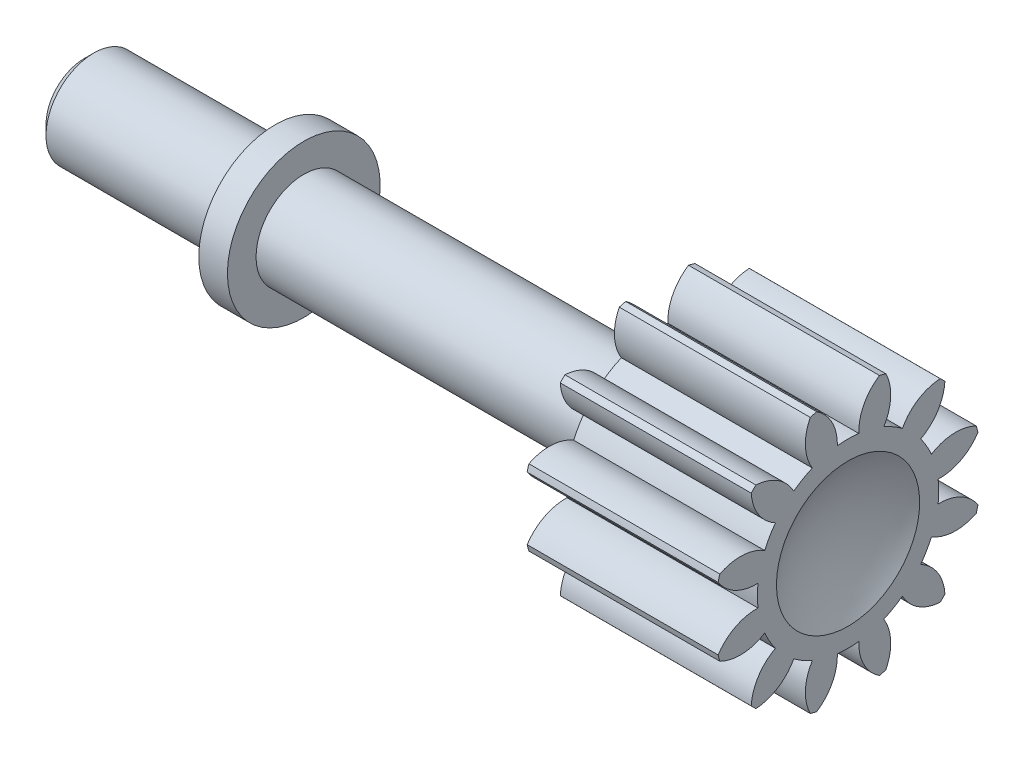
ISO-10303-21;
HEADER;
FILE_DESCRIPTION(('STEP AP214'),'2;1');
FILE_NAME('part.step','',(''),(''),'','','');
FILE_SCHEMA(('AUTOMOTIVE_DESIGN { 1 0 10303 214 1 1 1 1 }'));
ENDSEC;
DATA;
#1=APPLICATION_CONTEXT('core data for automotive mechanical design processes');
#2=APPLICATION_PROTOCOL_DEFINITION('international standard','automotive_design',2000,#1);
#3=PRODUCT_CONTEXT('',#1,'mechanical');
#4=PRODUCT('Part','Part','',(#3));
#5=PRODUCT_RELATED_PRODUCT_CATEGORY('part','',(#4));
#6=PRODUCT_DEFINITION_FORMATION('','',#4);
#7=PRODUCT_DEFINITION_CONTEXT('part definition',#1,'design');
#8=PRODUCT_DEFINITION('design','',#6,#7);
#9=PRODUCT_DEFINITION_SHAPE('','',#8);
#10=(LENGTH_UNIT() NAMED_UNIT(*) SI_UNIT(.MILLI.,.METRE.));
#11=(NAMED_UNIT(*) PLANE_ANGLE_UNIT() SI_UNIT($,.RADIAN.));
#12=(NAMED_UNIT(*) SI_UNIT($,.STERADIAN.) SOLID_ANGLE_UNIT());
#13=UNCERTAINTY_MEASURE_WITH_UNIT(LENGTH_MEASURE(1.E-05),#10,'distance_accuracy_value','');
#14=(GEOMETRIC_REPRESENTATION_CONTEXT(3) GLOBAL_UNCERTAINTY_ASSIGNED_CONTEXT((#13)) GLOBAL_UNIT_ASSIGNED_CONTEXT((#10,
#11,#12)) REPRESENTATION_CONTEXT('',''));
#15=CARTESIAN_POINT('',(0.,0.,0.));
#16=DIRECTION('',(0.,0.,1.));
#17=DIRECTION('',(1.,0.,0.));
#18=AXIS2_PLACEMENT_3D('',#15,#16,#17);
#19=CARTESIAN_POINT('',(11.7423455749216,-4.46255320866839,-4.01737577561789));
#20=DIRECTION('',(-1.,0.,0.));
#21=DIRECTION('',(0.,0.,1.));
#22=AXIS2_PLACEMENT_3D('',#19,#20,#21);
#23=PLANE('',#22);
#24=CARTESIAN_POINT('',(11.7423455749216,0.500653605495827,-1.34242192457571));
#25=DIRECTION('',(-1.,0.,0.));
#26=DIRECTION('',(0.,0.86602540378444,-0.499999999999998));
#27=AXIS2_PLACEMENT_3D('',#24,#25,#26);
#28=CIRCLE('',#27,2.4);
#29=CARTESIAN_POINT('',(11.7423455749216,-1.61786525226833,-0.214646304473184));
#30=VERTEX_POINT('',#29);
#31=CARTESIAN_POINT('',(11.7423455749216,0.362898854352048,1.05362140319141));
#32=VERTEX_POINT('',#31);
#33=EDGE_CURVE('E462',#30,#32,#28,.T.);
#34=ORIENTED_EDGE('',*,*,#33,.F.);
#35=CARTESIAN_POINT('',(11.7423455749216,-4.46255320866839,-4.01737577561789));
#36=DIRECTION('',(-1.,0.,0.));
#37=DIRECTION('',(0.,0.86602540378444,-0.499999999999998));
#38=AXIS2_PLACEMENT_3D('',#35,#36,#37);
#39=CIRCLE('',#38,4.749);
#40=CARTESIAN_POINT('',(11.7423455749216,-2.59163686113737,0.347560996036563));
#41=VERTEX_POINT('',#40);
#42=EDGE_CURVE('E467',#41,#30,#39,.T.);
#43=ORIENTED_EDGE('',*,*,#42,.F.);
#44=CARTESIAN_POINT('',(11.7423455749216,-4.62757862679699,1.61836433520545));
#45=DIRECTION('',(-1.,0.,0.));
#46=DIRECTION('',(0.,0.86602540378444,-0.499999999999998));
#47=AXIS2_PLACEMENT_3D('',#44,#45,#46);
#48=CIRCLE('',#47,2.4);
#49=CARTESIAN_POINT('',(11.7423455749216,-2.48366686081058,2.6970868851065));
#50=VERTEX_POINT('',#49);
#51=EDGE_CURVE('E464',#50,#41,#48,.T.);
#52=ORIENTED_EDGE('',*,*,#51,.F.);
#53=CARTESIAN_POINT('',(11.7423455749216,-4.46255320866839,-4.01737577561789));
#54=DIRECTION('',(-1.,0.,0.));
#55=DIRECTION('',(0.,0.,1.));
#56=AXIS2_PLACEMENT_3D('',#53,#54,#55);
#57=CIRCLE('',#56,7.);
#58=CARTESIAN_POINT('',(11.7423455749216,-2.81908772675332,2.7869626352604));
#59=VERTEX_POINT('',#58);
#60=EDGE_CURVE('E949',#59,#50,#57,.T.);
#61=ORIENTED_EDGE('',*,*,#60,.F.);
#62=CARTESIAN_POINT('',(11.7423455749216,-1.50176694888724,0.780805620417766));
#63=DIRECTION('',(-1.,0.,0.));
#64=DIRECTION('',(0.,1.,0.));
#65=AXIS2_PLACEMENT_3D('',#62,#63,#64);
#66=CIRCLE('',#65,2.4);
#67=CARTESIAN_POINT('',(11.7423455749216,-3.90034590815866,0.698228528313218));
#68=VERTEX_POINT('',#67);
#69=EDGE_CURVE('E478',#68,#59,#66,.T.);
#70=ORIENTED_EDGE('',*,*,#69,.F.);
#71=CARTESIAN_POINT('',(11.7423455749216,-4.46255320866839,-4.01737577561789));
#72=DIRECTION('',(-1.,0.,0.));
#73=DIRECTION('',(0.,1.,0.));
#74=AXIS2_PLACEMENT_3D('',#71,#72,#73);
#75=CIRCLE('',#74,4.749);
#76=CARTESIAN_POINT('',(11.7423455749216,-5.02476050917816,0.698228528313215));
#77=VERTEX_POINT('',#76);
#78=EDGE_CURVE('E483',#77,#68,#75,.T.);
#79=ORIENTED_EDGE('',*,*,#78,.F.);
#80=CARTESIAN_POINT('',(11.7423455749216,-7.42333946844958,0.780805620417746));
#81=DIRECTION('',(-1.,0.,0.));
#82=DIRECTION('',(0.,1.,0.));
#83=AXIS2_PLACEMENT_3D('',#80,#81,#82);
#84=CIRCLE('',#83,2.4);
#85=CARTESIAN_POINT('',(11.7423455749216,-6.10601869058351,2.78696263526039));
#86=VERTEX_POINT('',#85);
#87=EDGE_CURVE('E480',#86,#77,#84,.T.);
#88=ORIENTED_EDGE('',*,*,#87,.F.);
#89=CARTESIAN_POINT('',(11.7423455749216,-6.44143955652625,2.69708688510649));
#90=VERTEX_POINT('',#89);
#91=EDGE_CURVE('E952',#90,#86,#57,.T.);
#92=ORIENTED_EDGE('',*,*,#91,.F.);
#93=CARTESIAN_POINT('',(11.7423455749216,-4.29752779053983,1.61836433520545));
#94=DIRECTION('',(-1.,0.,0.));
#95=DIRECTION('',(0.,0.866025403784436,0.500000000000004));
#96=AXIS2_PLACEMENT_3D('',#93,#94,#95);
#97=CIRCLE('',#96,2.4);
#98=CARTESIAN_POINT('',(11.7423455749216,-6.33346955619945,0.347560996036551));
#99=VERTEX_POINT('',#98);
#100=EDGE_CURVE('E531',#99,#90,#97,.T.);
#101=ORIENTED_EDGE('',*,*,#100,.F.);
#102=CARTESIAN_POINT('',(11.7423455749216,-4.46255320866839,-4.01737577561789));
#103=DIRECTION('',(-1.,0.,0.));
#104=DIRECTION('',(0.,0.866025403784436,0.500000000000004));
#105=AXIS2_PLACEMENT_3D('',#102,#103,#104);
#106=CIRCLE('',#105,4.749);
#107=CARTESIAN_POINT('',(11.7423455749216,-7.30724116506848,-0.214646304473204));
#108=VERTEX_POINT('',#107);
#109=EDGE_CURVE('E536',#108,#99,#106,.T.);
#110=ORIENTED_EDGE('',*,*,#109,.F.);
#111=CARTESIAN_POINT('',(11.7423455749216,-9.42576002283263,-1.34242192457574));
#112=DIRECTION('',(-1.,0.,0.));
#113=DIRECTION('',(0.,0.866025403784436,0.500000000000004));
#114=AXIS2_PLACEMENT_3D('',#111,#112,#113);
#115=CIRCLE('',#114,2.4);
#116=CARTESIAN_POINT('',(11.7423455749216,-9.28800527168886,1.05362140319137));
#117=VERTEX_POINT('',#116);
#118=EDGE_CURVE('E533',#117,#108,#115,.T.);
#119=ORIENTED_EDGE('',*,*,#118,.F.);
#120=CARTESIAN_POINT('',(11.7423455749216,-9.5335503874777,0.808076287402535));
#121=VERTEX_POINT('',#120);
#122=EDGE_CURVE('E954',#121,#117,#57,.T.);
#123=ORIENTED_EDGE('',*,*,#122,.F.);
#124=CARTESIAN_POINT('',(11.7423455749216,-7.13750705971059,0.945831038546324));
#125=DIRECTION('',(-1.,0.,0.));
#126=DIRECTION('',(0.,0.499999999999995,0.866025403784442));
#127=AXIS2_PLACEMENT_3D('',#124,#125,#126);
#128=CIRCLE('',#127,2.4);
#129=CARTESIAN_POINT('',(11.7423455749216,-8.2652826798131,-1.17268781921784));
#130=VERTEX_POINT('',#129);
#131=EDGE_CURVE('E495',#130,#121,#128,.T.);
#132=ORIENTED_EDGE('',*,*,#131,.F.);
#133=CARTESIAN_POINT('',(11.7423455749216,-4.46255320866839,-4.01737577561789));
#134=DIRECTION('',(-1.,0.,0.));
#135=DIRECTION('',(0.,0.499999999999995,0.866025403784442));
#136=AXIS2_PLACEMENT_3D('',#133,#134,#135);
#137=CIRCLE('',#136,4.749);
#138=CARTESIAN_POINT('',(11.7423455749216,-8.82748998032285,-2.14645942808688));
#139=VERTEX_POINT('',#138);
#140=EDGE_CURVE('E500',#139,#130,#137,.T.);
#141=ORIENTED_EDGE('',*,*,#140,.F.);
#142=CARTESIAN_POINT('',(11.7423455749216,-10.0982933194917,-4.1824011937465));
#143=DIRECTION('',(-1.,0.,0.));
#144=DIRECTION('',(0.,0.499999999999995,0.866025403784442));
#145=AXIS2_PLACEMENT_3D('',#142,#143,#144);
#146=CIRCLE('',#145,2.4);
#147=CARTESIAN_POINT('',(11.7423455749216,-11.1770158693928,-2.03848942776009));
#148=VERTEX_POINT('',#147);
#149=EDGE_CURVE('E497',#148,#139,#146,.T.);
#150=ORIENTED_EDGE('',*,*,#149,.F.);
#151=CARTESIAN_POINT('',(11.7423455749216,-11.2668916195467,-2.37391029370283));
#152=VERTEX_POINT('',#151);
#153=EDGE_CURVE('E987',#152,#148,#57,.T.);
#154=ORIENTED_EDGE('',*,*,#153,.F.);
#155=CARTESIAN_POINT('',(11.7423455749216,-9.26073460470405,-1.05658951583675));
#156=DIRECTION('',(-1.,0.,0.));
#157=DIRECTION('',(0.,0.,1.));
#158=AXIS2_PLACEMENT_3D('',#155,#156,#157);
#159=CIRCLE('',#158,2.4);
#160=CARTESIAN_POINT('',(11.7423455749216,-9.1781575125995,-3.45516847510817));
#161=VERTEX_POINT('',#160);
#162=EDGE_CURVE('E514',#161,#152,#159,.T.);
#163=ORIENTED_EDGE('',*,*,#162,.F.);
#164=CARTESIAN_POINT('',(11.7423455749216,-4.46255320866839,-4.01737577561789));
#165=DIRECTION('',(-1.,0.,0.));
#166=DIRECTION('',(0.,0.,1.));
#167=AXIS2_PLACEMENT_3D('',#164,#165,#166);
#168=CIRCLE('',#167,4.749);
#169=CARTESIAN_POINT('',(11.7423455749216,-9.17815751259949,-4.57958307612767));
#170=VERTEX_POINT('',#169);
#171=EDGE_CURVE('E519',#170,#161,#168,.T.);
#172=ORIENTED_EDGE('',*,*,#171,.F.);
#173=CARTESIAN_POINT('',(11.7423455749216,-9.26073460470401,-6.97816203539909));
#174=DIRECTION('',(-1.,0.,0.));
#175=DIRECTION('',(0.,0.,1.));
#176=AXIS2_PLACEMENT_3D('',#173,#174,#175);
#177=CIRCLE('',#176,2.4);
#178=CARTESIAN_POINT('',(11.7423455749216,-11.2668916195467,-5.66084125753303));
#179=VERTEX_POINT('',#178);
#180=EDGE_CURVE('E516',#179,#170,#177,.T.);
#181=ORIENTED_EDGE('',*,*,#180,.F.);
#182=CARTESIAN_POINT('',(11.7423455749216,-11.1770158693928,-5.99626212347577));
#183=VERTEX_POINT('',#182);
#184=EDGE_CURVE('E981',#183,#179,#57,.T.);
#185=ORIENTED_EDGE('',*,*,#184,.F.);
#186=CARTESIAN_POINT('',(11.7423455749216,-10.0982933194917,-3.85235035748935));
#187=DIRECTION('',(-1.,0.,0.));
#188=DIRECTION('',(0.,-0.500000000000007,0.866025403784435));
#189=AXIS2_PLACEMENT_3D('',#186,#187,#188);
#190=CIRCLE('',#189,2.4);
#191=CARTESIAN_POINT('',(11.7423455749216,-8.82748998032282,-5.88829212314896));
#192=VERTEX_POINT('',#191);
#193=EDGE_CURVE('E565',#192,#183,#190,.T.);
#194=ORIENTED_EDGE('',*,*,#193,.F.);
#195=CARTESIAN_POINT('',(11.7423455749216,-4.46255320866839,-4.01737577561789));
#196=DIRECTION('',(-1.,0.,0.));
#197=DIRECTION('',(0.,-0.500000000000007,0.866025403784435));
#198=AXIS2_PLACEMENT_3D('',#195,#196,#197);
#199=CIRCLE('',#198,4.749);
#200=CARTESIAN_POINT('',(11.7423455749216,-8.26528267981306,-6.86206373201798));
#201=VERTEX_POINT('',#200);
#202=EDGE_CURVE('E570',#201,#192,#199,.T.);
#203=ORIENTED_EDGE('',*,*,#202,.F.);
#204=CARTESIAN_POINT('',(11.7423455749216,-7.13750705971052,-8.98058258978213));
#205=DIRECTION('',(-1.,0.,0.));
#206=DIRECTION('',(0.,-0.500000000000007,0.866025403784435));
#207=AXIS2_PLACEMENT_3D('',#204,#205,#206);
#208=CIRCLE('',#207,2.4);
#209=CARTESIAN_POINT('',(11.7423455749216,-9.53355038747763,-8.84282783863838));
#210=VERTEX_POINT('',#209);
#211=EDGE_CURVE('E567',#210,#201,#208,.T.);
#212=ORIENTED_EDGE('',*,*,#211,.F.);
#213=CARTESIAN_POINT('',(11.7423455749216,-9.28800527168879,-9.08837295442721));
#214=VERTEX_POINT('',#213);
#215=EDGE_CURVE('E975',#214,#210,#57,.T.);
#216=ORIENTED_EDGE('',*,*,#215,.F.);
#217=CARTESIAN_POINT('',(11.7423455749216,-9.42576002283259,-6.6923296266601));
#218=DIRECTION('',(-1.,0.,0.));
#219=DIRECTION('',(0.,-0.866025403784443,0.499999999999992));
#220=AXIS2_PLACEMENT_3D('',#217,#218,#219);
#221=CIRCLE('',#220,2.4);
#222=CARTESIAN_POINT('',(11.7423455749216,-7.30724116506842,-7.82010524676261));
#223=VERTEX_POINT('',#222);
#224=EDGE_CURVE('E546',#223,#214,#221,.T.);
#225=ORIENTED_EDGE('',*,*,#224,.F.);
#226=CARTESIAN_POINT('',(11.7423455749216,-4.46255320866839,-4.01737577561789));
#227=DIRECTION('',(-1.,0.,0.));
#228=DIRECTION('',(0.,-0.866025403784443,0.499999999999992));
#229=AXIS2_PLACEMENT_3D('',#226,#227,#228);
#230=CIRCLE('',#229,4.749);
#231=CARTESIAN_POINT('',(11.7423455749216,-6.33346955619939,-8.38231254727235));
#232=VERTEX_POINT('',#231);
#233=EDGE_CURVE('E551',#232,#223,#230,.T.);
#234=ORIENTED_EDGE('',*,*,#233,.F.);
#235=CARTESIAN_POINT('',(11.7423455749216,-4.29752779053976,-9.65311588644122));
#236=DIRECTION('',(-1.,0.,0.));
#237=DIRECTION('',(0.,-0.866025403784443,0.499999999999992));
#238=AXIS2_PLACEMENT_3D('',#235,#236,#237);
#239=CIRCLE('',#238,2.4);
#240=CARTESIAN_POINT('',(11.7423455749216,-6.44143955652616,-10.7318384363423));
#241=VERTEX_POINT('',#240);
#242=EDGE_CURVE('E548',#241,#232,#239,.T.);
#243=ORIENTED_EDGE('',*,*,#242,.F.);
#244=CARTESIAN_POINT('',(11.7423455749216,-6.10601869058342,-10.8217141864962));
#245=VERTEX_POINT('',#244);
#246=EDGE_CURVE('E969',#245,#241,#57,.T.);
#247=ORIENTED_EDGE('',*,*,#246,.F.);
#248=CARTESIAN_POINT('',(11.7423455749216,-7.42333946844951,-8.81555717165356));
#249=DIRECTION('',(-1.,0.,0.));
#250=DIRECTION('',(0.,-1.,0.));
#251=AXIS2_PLACEMENT_3D('',#248,#249,#250);
#252=CIRCLE('',#251,2.4);
#253=CARTESIAN_POINT('',(11.7423455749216,-5.02476050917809,-8.73298007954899));
#254=VERTEX_POINT('',#253);
#255=EDGE_CURVE('E580',#254,#245,#252,.T.);
#256=ORIENTED_EDGE('',*,*,#255,.F.);
#257=CARTESIAN_POINT('',(11.7423455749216,-4.46255320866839,-4.01737577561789));
#258=DIRECTION('',(-1.,0.,0.));
#259=DIRECTION('',(0.,-1.,0.));
#260=AXIS2_PLACEMENT_3D('',#257,#258,#259);
#261=CIRCLE('',#260,4.749);
#262=CARTESIAN_POINT('',(11.7423455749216,-3.90034590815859,-8.73298007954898));
#263=VERTEX_POINT('',#262);
#264=EDGE_CURVE('E585',#263,#254,#261,.T.);
#265=ORIENTED_EDGE('',*,*,#264,.F.);
#266=CARTESIAN_POINT('',(11.7423455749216,-1.50176694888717,-8.8155571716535));
#267=DIRECTION('',(-1.,0.,0.));
#268=DIRECTION('',(0.,-1.,0.));
#269=AXIS2_PLACEMENT_3D('',#266,#267,#268);
#270=CIRCLE('',#269,2.4);
#271=CARTESIAN_POINT('',(11.7423455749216,-2.81908772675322,-10.8217141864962));
#272=VERTEX_POINT('',#271);
#273=EDGE_CURVE('E582',#272,#263,#270,.T.);
#274=ORIENTED_EDGE('',*,*,#273,.F.);
#275=CARTESIAN_POINT('',(11.7423455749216,-2.48366686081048,-10.7318384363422));
#276=VERTEX_POINT('',#275);
#277=EDGE_CURVE('E963',#276,#272,#57,.T.);
#278=ORIENTED_EDGE('',*,*,#277,.F.);
#279=CARTESIAN_POINT('',(11.7423455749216,-4.62757862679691,-9.65311588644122));
#280=DIRECTION('',(-1.,0.,0.));
#281=DIRECTION('',(0.,-0.866025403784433,-0.50000000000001));
#282=AXIS2_PLACEMENT_3D('',#279,#280,#281);
#283=CIRCLE('',#282,2.4);
#284=CARTESIAN_POINT('',(11.7423455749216,-2.5916368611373,-8.38231254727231));
#285=VERTEX_POINT('',#284);
#286=EDGE_CURVE('E614',#285,#276,#283,.T.);
#287=ORIENTED_EDGE('',*,*,#286,.F.);
#288=CARTESIAN_POINT('',(11.7423455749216,-4.46255320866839,-4.01737577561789));
#289=DIRECTION('',(-1.,0.,0.));
#290=DIRECTION('',(0.,-0.866025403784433,-0.50000000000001));
#291=AXIS2_PLACEMENT_3D('',#288,#289,#290);
#292=CIRCLE('',#291,4.749);
#293=CARTESIAN_POINT('',(11.7423455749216,-1.61786525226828,-7.82010524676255));
#294=VERTEX_POINT('',#293);
#295=EDGE_CURVE('E619',#294,#285,#292,.T.);
#296=ORIENTED_EDGE('',*,*,#295,.F.);
#297=CARTESIAN_POINT('',(11.7423455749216,0.500653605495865,-6.69232962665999));
#298=DIRECTION('',(-1.,0.,0.));
#299=DIRECTION('',(0.,-0.866025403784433,-0.50000000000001));
#300=AXIS2_PLACEMENT_3D('',#297,#298,#299);
#301=CIRCLE('',#300,2.4);
#302=CARTESIAN_POINT('',(11.7423455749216,0.362898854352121,-9.08837295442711));
#303=VERTEX_POINT('',#302);
#304=EDGE_CURVE('E616',#303,#294,#301,.T.);
#305=ORIENTED_EDGE('',*,*,#304,.F.);
#306=CARTESIAN_POINT('',(11.7423455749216,0.608443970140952,-8.84282783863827));
#307=VERTEX_POINT('',#306);
#308=EDGE_CURVE('E723',#307,#303,#57,.T.);
#309=ORIENTED_EDGE('',*,*,#308,.F.);
#310=CARTESIAN_POINT('',(11.7423455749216,-1.78759935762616,-8.98058258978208));
#311=DIRECTION('',(-1.,0.,0.));
#312=DIRECTION('',(0.,-0.499999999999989,-0.866025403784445));
#313=AXIS2_PLACEMENT_3D('',#310,#311,#312);
#314=CIRCLE('',#313,2.4);
#315=CARTESIAN_POINT('',(11.7423455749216,-0.65982373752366,-6.8620637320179));
#316=VERTEX_POINT('',#315);
#317=EDGE_CURVE('E597',#316,#307,#314,.T.);
#318=ORIENTED_EDGE('',*,*,#317,.F.);
#319=CARTESIAN_POINT('',(11.7423455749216,-4.46255320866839,-4.01737577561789));
#320=DIRECTION('',(-1.,0.,0.));
#321=DIRECTION('',(0.,-0.499999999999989,-0.866025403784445));
#322=AXIS2_PLACEMENT_3D('',#319,#320,#321);
#323=CIRCLE('',#322,4.749);
#324=CARTESIAN_POINT('',(11.7423455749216,-0.0976164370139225,-5.88829212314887));
#325=VERTEX_POINT('',#324);
#326=EDGE_CURVE('E602',#325,#316,#323,.T.);
#327=ORIENTED_EDGE('',*,*,#326,.F.);
#328=CARTESIAN_POINT('',(11.7423455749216,1.17318690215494,-3.85235035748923));
#329=DIRECTION('',(-1.,0.,0.));
#330=DIRECTION('',(0.,-0.499999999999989,-0.866025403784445));
#331=AXIS2_PLACEMENT_3D('',#328,#329,#330);
#332=CIRCLE('',#331,2.4);
#333=CARTESIAN_POINT('',(11.7423455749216,2.25190945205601,-5.99626212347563));
#334=VERTEX_POINT('',#333);
#335=EDGE_CURVE('E599',#334,#325,#332,.T.);
#336=ORIENTED_EDGE('',*,*,#335,.F.);
#337=CARTESIAN_POINT('',(11.7423455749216,2.34178520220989,-5.66084125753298));
#338=VERTEX_POINT('',#337);
#339=EDGE_CURVE('E719',#338,#334,#57,.T.);
#340=ORIENTED_EDGE('',*,*,#339,.F.);
#341=CARTESIAN_POINT('',(11.7423455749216,0.335628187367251,-6.97816203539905));
#342=DIRECTION('',(-1.,0.,0.));
#343=DIRECTION('',(0.,0.,-1.));
#344=AXIS2_PLACEMENT_3D('',#341,#342,#343);
#345=CIRCLE('',#344,2.4);
#346=CARTESIAN_POINT('',(11.7423455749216,0.253051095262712,-4.57958307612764));
#347=VERTEX_POINT('',#346);
#348=EDGE_CURVE('E691',#347,#338,#345,.T.);
#349=ORIENTED_EDGE('',*,*,#348,.F.);
#350=CARTESIAN_POINT('',(11.7423455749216,-4.46255320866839,-4.01737577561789));
#351=DIRECTION('',(-1.,0.,0.));
#352=DIRECTION('',(0.,0.,-1.));
#353=AXIS2_PLACEMENT_3D('',#350,#351,#352);
#354=CIRCLE('',#353,4.749);
#355=CARTESIAN_POINT('',(11.7423455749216,0.253051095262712,-3.45516847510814));
#356=VERTEX_POINT('',#355);
#357=EDGE_CURVE('E696',#356,#347,#354,.T.);
#358=ORIENTED_EDGE('',*,*,#357,.F.);
#359=CARTESIAN_POINT('',(11.7423455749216,0.335628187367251,-1.05658951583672));
#360=DIRECTION('',(-1.,0.,0.));
#361=DIRECTION('',(0.,0.,-1.));
#362=AXIS2_PLACEMENT_3D('',#359,#360,#361);
#363=CIRCLE('',#362,2.4);
#364=CARTESIAN_POINT('',(11.7423455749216,2.34178520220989,-2.37391029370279));
#365=VERTEX_POINT('',#364);
#366=EDGE_CURVE('E693',#365,#356,#363,.T.);
#367=ORIENTED_EDGE('',*,*,#366,.F.);
#368=CARTESIAN_POINT('',(11.7423455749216,2.25190945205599,-2.03848942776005));
#369=VERTEX_POINT('',#368);
#370=EDGE_CURVE('E716',#369,#365,#57,.T.);
#371=ORIENTED_EDGE('',*,*,#370,.F.);
#372=CARTESIAN_POINT('',(11.7423455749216,1.17318690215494,-4.18240119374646));
#373=DIRECTION('',(-1.,0.,0.));
#374=DIRECTION('',(0.,0.500000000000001,-0.866025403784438));
#375=AXIS2_PLACEMENT_3D('',#372,#373,#374);
#376=CIRCLE('',#375,2.4);
#377=CARTESIAN_POINT('',(11.7423455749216,-0.0976164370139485,-2.14645942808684));
#378=VERTEX_POINT('',#377);
#379=EDGE_CURVE('E669',#378,#369,#376,.T.);
#380=ORIENTED_EDGE('',*,*,#379,.F.);
#381=CARTESIAN_POINT('',(11.7423455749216,-4.46255320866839,-4.01737577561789));
#382=DIRECTION('',(-1.,0.,0.));
#383=DIRECTION('',(0.,0.500000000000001,-0.866025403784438));
#384=AXIS2_PLACEMENT_3D('',#381,#382,#383);
#385=CIRCLE('',#384,4.749);
#386=CARTESIAN_POINT('',(11.7423455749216,-0.6598237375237,-1.17268781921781));
#387=VERTEX_POINT('',#386);
#388=EDGE_CURVE('E674',#387,#378,#385,.T.);
#389=ORIENTED_EDGE('',*,*,#388,.F.);
#390=CARTESIAN_POINT('',(11.7423455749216,-1.78759935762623,0.945831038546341));
#391=DIRECTION('',(-1.,0.,0.));
#392=DIRECTION('',(0.,0.500000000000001,-0.866025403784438));
#393=AXIS2_PLACEMENT_3D('',#390,#391,#392);
#394=CIRCLE('',#393,2.4);
#395=CARTESIAN_POINT('',(11.7423455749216,0.608443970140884,0.808076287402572));
#396=VERTEX_POINT('',#395);
#397=EDGE_CURVE('E671',#396,#387,#394,.T.);
#398=ORIENTED_EDGE('',*,*,#397,.F.);
#399=EDGE_CURVE('E724',#32,#396,#57,.T.);
#400=ORIENTED_EDGE('',*,*,#399,.F.);
#401=EDGE_LOOP('',(#34,#43,#52,#61,#70,#79,#88,#92,#101,#110,#119,#123,#132,#141,#150,#154,#163,
#172,#181,#185,#194,#203,#212,#216,#225,#234,#243,#247,#256,#265,#274,#278,#287,#296,#305,#309,
#318,#327,#336,#340,#349,#358,#367,#371,#380,#389,#398,#400));
#402=FACE_BOUND('',#401,.T.);
#403=CARTESIAN_POINT('',(11.7423455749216,-4.46255320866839,-4.01737577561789));
#404=DIRECTION('',(-1.,0.,0.));
#405=DIRECTION('',(0.,0.,1.));
#406=AXIS2_PLACEMENT_3D('',#403,#404,#405);
#407=CIRCLE('',#406,3.75);
#408=CARTESIAN_POINT('',(11.7423455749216,-4.46255320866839,-0.267375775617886));
#409=VERTEX_POINT('',#408);
#410=EDGE_CURVE('E13',#409,#409,#407,.F.);
#411=ORIENTED_EDGE('',*,*,#410,.F.);
#412=EDGE_LOOP('',(#411));
#413=FACE_BOUND('',#412,.T.);
#414=ADVANCED_FACE('F39',(#402,#413),#23,.F.);
#415=CARTESIAN_POINT('',(-28.2577052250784,-4.46255320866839,-4.01737577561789));
#416=DIRECTION('',(1.,0.,0.));
#417=DIRECTION('',(0.,0.,-1.));
#418=AXIS2_PLACEMENT_3D('',#415,#416,#417);
#419=CYLINDRICAL_SURFACE('',#418,2.5);
#420=CARTESIAN_POINT('',(1.74234557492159,-4.46255320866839,-4.01737577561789));
#421=DIRECTION('',(1.,0.,0.));
#422=DIRECTION('',(0.,0.,-1.));
#423=AXIS2_PLACEMENT_3D('',#420,#421,#422);
#424=CIRCLE('',#423,2.5);
#425=CARTESIAN_POINT('',(1.74234557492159,-4.46255320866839,-6.51737577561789));
#426=VERTEX_POINT('',#425);
#427=EDGE_CURVE('E750',#426,#426,#424,.F.);
#428=ORIENTED_EDGE('',*,*,#427,.T.);
#429=EDGE_LOOP('',(#428));
#430=FACE_BOUND('',#429,.T.);
#431=CARTESIAN_POINT('',(-16.7577052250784,-4.46255320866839,-4.01737577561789));
#432=DIRECTION('',(-1.,0.,0.));
#433=DIRECTION('',(0.,0.,1.));
#434=AXIS2_PLACEMENT_3D('',#431,#432,#433);
#435=CIRCLE('',#434,2.5);
#436=CARTESIAN_POINT('',(-16.7577052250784,-4.46255320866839,-1.51737577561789));
#437=VERTEX_POINT('',#436);
#438=EDGE_CURVE('E753',#437,#437,#435,.T.);
#439=ORIENTED_EDGE('',*,*,#438,.F.);
#440=EDGE_LOOP('',(#439));
#441=FACE_BOUND('',#440,.T.);
#442=ADVANCED_FACE('F440',(#430,#441),#419,.T.);
#443=CARTESIAN_POINT('',(18.2735955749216,-4.46255320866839,-4.01737577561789));
#444=DIRECTION('',(0.,0.,1.));
#445=DIRECTION('',(1.,0.,0.));
#446=AXIS2_PLACEMENT_3D('',#443,#444,#445);
#447=SPHERICAL_SURFACE('',#446,7.53125000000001);
#448=CARTESIAN_POINT('',(18.2735955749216,-4.46255320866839,-4.01737577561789));
#449=DIRECTION('',(-1.,0.,0.));
#450=DIRECTION('',(0.,0.,1.));
#451=AXIS2_PLACEMENT_3D('',#448,#449,#450);
#452=SPHERICAL_SURFACE('',#451,7.53125000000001);
#453=ORIENTED_EDGE('',*,*,#410,.T.);
#454=EDGE_LOOP('',(#453));
#455=FACE_BOUND('',#454,.T.);
#456=ADVANCED_FACE('F41',(#455),#452,.F.);
#457=CARTESIAN_POINT('',(-8.25765442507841,-4.46255320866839,-4.01737577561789));
#458=DIRECTION('',(-1.,0.,0.));
#459=DIRECTION('',(0.,0.,1.));
#460=AXIS2_PLACEMENT_3D('',#457,#458,#459);
#461=CYLINDRICAL_SURFACE('',#460,7.);
#462=DIRECTION('',(-1.,0.,0.));
#463=VECTOR('',#462,1.);
#464=CARTESIAN_POINT('',(6.74234557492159,0.36289885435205,1.05362140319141));
#465=LINE('',#464,#463);
#466=CARTESIAN_POINT('',(1.74234557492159,0.362898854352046,1.05362140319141));
#467=VERTEX_POINT('',#466);
#468=EDGE_CURVE('E666',#32,#467,#465,.T.);
#469=ORIENTED_EDGE('',*,*,#468,.F.);
#470=ORIENTED_EDGE('',*,*,#399,.T.);
#471=DIRECTION('',(-1.,0.,0.));
#472=VECTOR('',#471,1.);
#473=CARTESIAN_POINT('',(6.74234557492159,0.608443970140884,0.808076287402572));
#474=LINE('',#473,#472);
#475=CARTESIAN_POINT('',(1.74234557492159,0.608443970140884,0.808076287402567));
#476=VERTEX_POINT('',#475);
#477=EDGE_CURVE('E685',#476,#396,#474,.F.);
#478=ORIENTED_EDGE('',*,*,#477,.F.);
#479=CARTESIAN_POINT('',(1.74234557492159,-4.46255320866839,-4.01737577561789));
#480=DIRECTION('',(-1.,0.,0.));
#481=DIRECTION('',(0.,0.,1.));
#482=AXIS2_PLACEMENT_3D('',#479,#480,#481);
#483=CIRCLE('',#482,7.);
#484=EDGE_CURVE('E718',#467,#476,#483,.T.);
#485=ORIENTED_EDGE('',*,*,#484,.F.);
#486=EDGE_LOOP('',(#469,#470,#478,#485));
#487=FACE_BOUND('',#486,.T.);
#488=ADVANCED_FACE('F792',(#487),#461,.T.);
#489=DIRECTION('',(-1.,0.,0.));
#490=VECTOR('',#489,1.);
#491=CARTESIAN_POINT('',(6.74234557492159,-2.48366686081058,2.6970868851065));
#492=LINE('',#491,#490);
#493=CARTESIAN_POINT('',(1.74234557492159,-2.48366686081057,2.69708688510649));
#494=VERTEX_POINT('',#493);
#495=EDGE_CURVE('E664',#494,#50,#492,.F.);
#496=ORIENTED_EDGE('',*,*,#495,.F.);
#497=CARTESIAN_POINT('',(1.74234557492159,-2.81908772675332,2.7869626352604));
#498=VERTEX_POINT('',#497);
#499=EDGE_CURVE('E1021',#498,#494,#483,.T.);
#500=ORIENTED_EDGE('',*,*,#499,.F.);
#501=DIRECTION('',(-1.,0.,0.));
#502=VECTOR('',#501,1.);
#503=CARTESIAN_POINT('',(6.74234557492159,-2.81908772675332,2.7869626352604));
#504=LINE('',#503,#502);
#505=EDGE_CURVE('E662',#59,#498,#504,.T.);
#506=ORIENTED_EDGE('',*,*,#505,.F.);
#507=ORIENTED_EDGE('',*,*,#60,.T.);
#508=EDGE_LOOP('',(#496,#500,#506,#507));
#509=FACE_BOUND('',#508,.T.);
#510=ADVANCED_FACE('F951',(#509),#461,.T.);
#511=DIRECTION('',(-1.,0.,0.));
#512=VECTOR('',#511,1.);
#513=CARTESIAN_POINT('',(6.74234557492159,-6.10601869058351,2.78696263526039));
#514=LINE('',#513,#512);
#515=CARTESIAN_POINT('',(1.74234557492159,-6.10601869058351,2.78696263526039));
#516=VERTEX_POINT('',#515);
#517=EDGE_CURVE('E660',#516,#86,#514,.F.);
#518=ORIENTED_EDGE('',*,*,#517,.F.);
#519=CARTESIAN_POINT('',(1.74234557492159,-6.44143955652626,2.69708688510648));
#520=VERTEX_POINT('',#519);
#521=EDGE_CURVE('E1017',#520,#516,#483,.T.);
#522=ORIENTED_EDGE('',*,*,#521,.F.);
#523=DIRECTION('',(-1.,0.,0.));
#524=VECTOR('',#523,1.);
#525=CARTESIAN_POINT('',(6.74234557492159,-6.44143955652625,2.69708688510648));
#526=LINE('',#525,#524);
#527=EDGE_CURVE('E650',#90,#520,#526,.T.);
#528=ORIENTED_EDGE('',*,*,#527,.F.);
#529=ORIENTED_EDGE('',*,*,#91,.T.);
#530=EDGE_LOOP('',(#518,#522,#528,#529));
#531=FACE_BOUND('',#530,.T.);
#532=ADVANCED_FACE('F1062',(#531),#461,.T.);
#533=DIRECTION('',(-1.,0.,0.));
#534=VECTOR('',#533,1.);
#535=CARTESIAN_POINT('',(6.74234557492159,-11.2668916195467,-2.37391029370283));
#536=LINE('',#535,#534);
#537=CARTESIAN_POINT('',(1.74234557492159,-11.2668916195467,-2.37391029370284));
#538=VERTEX_POINT('',#537);
#539=EDGE_CURVE('E658',#152,#538,#536,.T.);
#540=ORIENTED_EDGE('',*,*,#539,.F.);
#541=ORIENTED_EDGE('',*,*,#153,.T.);
#542=DIRECTION('',(-1.,0.,0.));
#543=VECTOR('',#542,1.);
#544=CARTESIAN_POINT('',(6.74234557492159,-11.1770158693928,-2.03848942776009));
#545=LINE('',#544,#543);
#546=CARTESIAN_POINT('',(1.74234557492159,-11.1770158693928,-2.03848942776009));
#547=VERTEX_POINT('',#546);
#548=EDGE_CURVE('E652',#547,#148,#545,.F.);
#549=ORIENTED_EDGE('',*,*,#548,.F.);
#550=EDGE_CURVE('E1016',#538,#547,#483,.T.);
#551=ORIENTED_EDGE('',*,*,#550,.F.);
#552=EDGE_LOOP('',(#540,#541,#549,#551));
#553=FACE_BOUND('',#552,.T.);
#554=ADVANCED_FACE('F1056',(#553),#461,.T.);
#555=DIRECTION('',(-1.,0.,0.));
#556=VECTOR('',#555,1.);
#557=CARTESIAN_POINT('',(6.74234557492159,-11.2668916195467,-5.66084125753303));
#558=LINE('',#557,#556);
#559=CARTESIAN_POINT('',(1.74234557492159,-11.2668916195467,-5.66084125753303));
#560=VERTEX_POINT('',#559);
#561=EDGE_CURVE('E656',#560,#179,#558,.F.);
#562=ORIENTED_EDGE('',*,*,#561,.F.);
#563=CARTESIAN_POINT('',(1.74234557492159,-11.1770158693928,-5.99626212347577));
#564=VERTEX_POINT('',#563);
#565=EDGE_CURVE('E1019',#564,#560,#483,.T.);
#566=ORIENTED_EDGE('',*,*,#565,.F.);
#567=DIRECTION('',(-1.,0.,0.));
#568=VECTOR('',#567,1.);
#569=CARTESIAN_POINT('',(6.74234557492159,-11.1770158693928,-5.99626212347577));
#570=LINE('',#569,#568);
#571=EDGE_CURVE('E642',#183,#564,#570,.T.);
#572=ORIENTED_EDGE('',*,*,#571,.F.);
#573=ORIENTED_EDGE('',*,*,#184,.T.);
#574=EDGE_LOOP('',(#562,#566,#572,#573));
#575=FACE_BOUND('',#574,.T.);
#576=ADVANCED_FACE('F1046',(#575),#461,.T.);
#577=DIRECTION('',(-1.,0.,0.));
#578=VECTOR('',#577,1.);
#579=CARTESIAN_POINT('',(6.74234557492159,-9.5335503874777,0.808076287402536));
#580=LINE('',#579,#578);
#581=CARTESIAN_POINT('',(1.74234557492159,-9.5335503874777,0.808076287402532));
#582=VERTEX_POINT('',#581);
#583=EDGE_CURVE('E654',#121,#582,#580,.T.);
#584=ORIENTED_EDGE('',*,*,#583,.F.);
#585=ORIENTED_EDGE('',*,*,#122,.T.);
#586=DIRECTION('',(-1.,0.,0.));
#587=VECTOR('',#586,1.);
#588=CARTESIAN_POINT('',(6.74234557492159,-9.28800527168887,1.05362140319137));
#589=LINE('',#588,#587);
#590=CARTESIAN_POINT('',(1.74234557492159,-9.28800527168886,1.05362140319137));
#591=VERTEX_POINT('',#590);
#592=EDGE_CURVE('E648',#591,#117,#589,.F.);
#593=ORIENTED_EDGE('',*,*,#592,.F.);
#594=EDGE_CURVE('E1015',#582,#591,#483,.T.);
#595=ORIENTED_EDGE('',*,*,#594,.F.);
#596=EDGE_LOOP('',(#584,#585,#593,#595));
#597=FACE_BOUND('',#596,.T.);
#598=ADVANCED_FACE('F1002',(#597),#461,.T.);
#599=DIRECTION('',(-1.,0.,0.));
#600=VECTOR('',#599,1.);
#601=CARTESIAN_POINT('',(6.74234557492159,-9.28800527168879,-9.08837295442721));
#602=LINE('',#601,#600);
#603=CARTESIAN_POINT('',(1.74234557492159,-9.28800527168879,-9.08837295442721));
#604=VERTEX_POINT('',#603);
#605=EDGE_CURVE('E646',#214,#604,#602,.T.);
#606=ORIENTED_EDGE('',*,*,#605,.F.);
#607=ORIENTED_EDGE('',*,*,#215,.T.);
#608=DIRECTION('',(-1.,0.,0.));
#609=VECTOR('',#608,1.);
#610=CARTESIAN_POINT('',(6.74234557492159,-9.53355038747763,-8.84282783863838));
#611=LINE('',#610,#609);
#612=CARTESIAN_POINT('',(1.74234557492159,-9.53355038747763,-8.84282783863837));
#613=VERTEX_POINT('',#612);
#614=EDGE_CURVE('E640',#613,#210,#611,.F.);
#615=ORIENTED_EDGE('',*,*,#614,.F.);
#616=EDGE_CURVE('E1037',#604,#613,#483,.T.);
#617=ORIENTED_EDGE('',*,*,#616,.F.);
#618=EDGE_LOOP('',(#606,#607,#615,#617));
#619=FACE_BOUND('',#618,.T.);
#620=ADVANCED_FACE('F1131',(#619),#461,.T.);
#621=DIRECTION('',(-1.,0.,0.));
#622=VECTOR('',#621,1.);
#623=CARTESIAN_POINT('',(6.74234557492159,-6.44143955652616,-10.7318384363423));
#624=LINE('',#623,#622);
#625=CARTESIAN_POINT('',(1.74234557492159,-6.44143955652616,-10.7318384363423));
#626=VERTEX_POINT('',#625);
#627=EDGE_CURVE('E644',#626,#241,#624,.F.);
#628=ORIENTED_EDGE('',*,*,#627,.F.);
#629=CARTESIAN_POINT('',(1.74234557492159,-6.10601869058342,-10.8217141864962));
#630=VERTEX_POINT('',#629);
#631=EDGE_CURVE('E1033',#630,#626,#483,.T.);
#632=ORIENTED_EDGE('',*,*,#631,.F.);
#633=DIRECTION('',(-1.,0.,0.));
#634=VECTOR('',#633,1.);
#635=CARTESIAN_POINT('',(6.74234557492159,-6.10601869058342,-10.8217141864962));
#636=LINE('',#635,#634);
#637=EDGE_CURVE('E638',#245,#630,#636,.T.);
#638=ORIENTED_EDGE('',*,*,#637,.F.);
#639=ORIENTED_EDGE('',*,*,#246,.T.);
#640=EDGE_LOOP('',(#628,#632,#638,#639));
#641=FACE_BOUND('',#640,.T.);
#642=ADVANCED_FACE('F1124',(#641),#461,.T.);
#643=DIRECTION('',(-1.,0.,0.));
#644=VECTOR('',#643,1.);
#645=CARTESIAN_POINT('',(6.74234557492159,-2.81908772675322,-10.8217141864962));
#646=LINE('',#645,#644);
#647=CARTESIAN_POINT('',(1.74234557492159,-2.81908772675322,-10.8217141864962));
#648=VERTEX_POINT('',#647);
#649=EDGE_CURVE('E636',#648,#272,#646,.F.);
#650=ORIENTED_EDGE('',*,*,#649,.F.);
#651=CARTESIAN_POINT('',(1.74234557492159,-2.48366686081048,-10.7318384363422));
#652=VERTEX_POINT('',#651);
#653=EDGE_CURVE('E1029',#652,#648,#483,.T.);
#654=ORIENTED_EDGE('',*,*,#653,.F.);
#655=DIRECTION('',(-1.,0.,0.));
#656=VECTOR('',#655,1.);
#657=CARTESIAN_POINT('',(6.74234557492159,-2.48366686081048,-10.7318384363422));
#658=LINE('',#657,#656);
#659=EDGE_CURVE('E630',#276,#652,#658,.T.);
#660=ORIENTED_EDGE('',*,*,#659,.F.);
#661=ORIENTED_EDGE('',*,*,#277,.T.);
#662=EDGE_LOOP('',(#650,#654,#660,#661));
#663=FACE_BOUND('',#662,.T.);
#664=ADVANCED_FACE('F1117',(#663),#461,.T.);
#665=DIRECTION('',(-1.,0.,0.));
#666=VECTOR('',#665,1.);
#667=CARTESIAN_POINT('',(6.74234557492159,0.608443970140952,-8.84282783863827));
#668=LINE('',#667,#666);
#669=CARTESIAN_POINT('',(1.74234557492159,0.608443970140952,-8.84282783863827));
#670=VERTEX_POINT('',#669);
#671=EDGE_CURVE('E634',#307,#670,#668,.T.);
#672=ORIENTED_EDGE('',*,*,#671,.F.);
#673=ORIENTED_EDGE('',*,*,#308,.T.);
#674=DIRECTION('',(-1.,0.,0.));
#675=VECTOR('',#674,1.);
#676=CARTESIAN_POINT('',(6.74234557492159,0.362898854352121,-9.08837295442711));
#677=LINE('',#676,#675);
#678=CARTESIAN_POINT('',(1.74234557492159,0.362898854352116,-9.08837295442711));
#679=VERTEX_POINT('',#678);
#680=EDGE_CURVE('E477',#679,#303,#677,.F.);
#681=ORIENTED_EDGE('',*,*,#680,.F.);
#682=EDGE_CURVE('E717',#670,#679,#483,.T.);
#683=ORIENTED_EDGE('',*,*,#682,.F.);
#684=EDGE_LOOP('',(#672,#673,#681,#683));
#685=FACE_BOUND('',#684,.T.);
#686=ADVANCED_FACE('F1110',(#685),#461,.T.);
#687=DIRECTION('',(-1.,0.,0.));
#688=VECTOR('',#687,1.);
#689=CARTESIAN_POINT('',(6.74234557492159,2.25190945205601,-5.99626212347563));
#690=LINE('',#689,#688);
#691=CARTESIAN_POINT('',(1.74234557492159,2.25190945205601,-5.99626212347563));
#692=VERTEX_POINT('',#691);
#693=EDGE_CURVE('E632',#692,#334,#690,.F.);
#694=ORIENTED_EDGE('',*,*,#693,.F.);
#695=CARTESIAN_POINT('',(1.74234557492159,2.34178520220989,-5.66084125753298));
#696=VERTEX_POINT('',#695);
#697=EDGE_CURVE('E713',#696,#692,#483,.T.);
#698=ORIENTED_EDGE('',*,*,#697,.F.);
#699=DIRECTION('',(-1.,0.,0.));
#700=VECTOR('',#699,1.);
#701=CARTESIAN_POINT('',(6.74234557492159,2.34178520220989,-5.66084125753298));
#702=LINE('',#701,#700);
#703=EDGE_CURVE('E710',#338,#696,#702,.T.);
#704=ORIENTED_EDGE('',*,*,#703,.F.);
#705=ORIENTED_EDGE('',*,*,#339,.T.);
#706=EDGE_LOOP('',(#694,#698,#704,#705));
#707=FACE_BOUND('',#706,.T.);
#708=ADVANCED_FACE('F793',(#707),#461,.T.);
#709=CARTESIAN_POINT('',(1.74234557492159,-4.46255320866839,-4.01737577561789));
#710=DIRECTION('',(1.,0.,0.));
#711=DIRECTION('',(0.,0.,-1.));
#712=AXIS2_PLACEMENT_3D('',#709,#710,#711);
#713=PLANE('',#712);
#714=ORIENTED_EDGE('',*,*,#427,.F.);
#715=EDGE_LOOP('',(#714));
#716=FACE_BOUND('',#715,.T.);
#717=CARTESIAN_POINT('',(1.74234557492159,0.500653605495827,-1.34242192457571));
#718=DIRECTION('',(-1.,0.,0.));
#719=DIRECTION('',(0.,0.86602540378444,-0.499999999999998));
#720=AXIS2_PLACEMENT_3D('',#717,#718,#719);
#721=CIRCLE('',#720,2.4);
#722=CARTESIAN_POINT('',(1.74234557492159,-1.61786525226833,-0.214646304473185));
#723=VERTEX_POINT('',#722);
#724=EDGE_CURVE('E63',#723,#467,#721,.T.);
#725=ORIENTED_EDGE('',*,*,#724,.T.);
#726=ORIENTED_EDGE('',*,*,#484,.T.);
#727=CARTESIAN_POINT('',(1.74234557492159,-1.78759935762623,0.945831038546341));
#728=DIRECTION('',(1.,0.,0.));
#729=DIRECTION('',(0.,0.,-1.));
#730=AXIS2_PLACEMENT_3D('',#727,#728,#729);
#731=CIRCLE('',#730,2.4);
#732=CARTESIAN_POINT('',(1.74234557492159,-0.6598237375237,-1.17268781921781));
#733=VERTEX_POINT('',#732);
#734=EDGE_CURVE('E727',#733,#476,#731,.T.);
#735=ORIENTED_EDGE('',*,*,#734,.F.);
#736=CARTESIAN_POINT('',(1.74234557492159,-4.46255320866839,-4.01737577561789));
#737=DIRECTION('',(-1.,0.,0.));
#738=DIRECTION('',(0.,0.500000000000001,-0.866025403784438));
#739=AXIS2_PLACEMENT_3D('',#736,#737,#738);
#740=CIRCLE('',#739,4.749);
#741=CARTESIAN_POINT('',(1.74234557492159,-0.0976164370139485,-2.14645942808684));
#742=VERTEX_POINT('',#741);
#743=EDGE_CURVE('E672',#733,#742,#740,.T.);
#744=ORIENTED_EDGE('',*,*,#743,.T.);
#745=CARTESIAN_POINT('',(1.74234557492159,1.17318690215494,-4.18240119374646));
#746=DIRECTION('',(-1.,0.,0.));
#747=DIRECTION('',(0.,0.500000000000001,-0.866025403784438));
#748=AXIS2_PLACEMENT_3D('',#745,#746,#747);
#749=CIRCLE('',#748,2.4);
#750=CARTESIAN_POINT('',(1.74234557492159,2.25190945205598,-2.03848942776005));
#751=VERTEX_POINT('',#750);
#752=EDGE_CURVE('E668',#742,#751,#749,.T.);
#753=ORIENTED_EDGE('',*,*,#752,.T.);
#754=CARTESIAN_POINT('',(1.74234557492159,2.34178520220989,-2.37391029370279));
#755=VERTEX_POINT('',#754);
#756=EDGE_CURVE('E712',#751,#755,#483,.T.);
#757=ORIENTED_EDGE('',*,*,#756,.T.);
#758=CARTESIAN_POINT('',(1.74234557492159,0.335628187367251,-1.05658951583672));
#759=DIRECTION('',(1.,0.,0.));
#760=DIRECTION('',(0.,0.,-1.));
#761=AXIS2_PLACEMENT_3D('',#758,#759,#760);
#762=CIRCLE('',#761,2.4);
#763=CARTESIAN_POINT('',(1.74234557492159,0.253051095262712,-3.45516847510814));
#764=VERTEX_POINT('',#763);
#765=EDGE_CURVE('E722',#764,#755,#762,.T.);
#766=ORIENTED_EDGE('',*,*,#765,.F.);
#767=CARTESIAN_POINT('',(1.74234557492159,-4.46255320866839,-4.01737577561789));
#768=DIRECTION('',(-1.,0.,0.));
#769=DIRECTION('',(0.,0.,-1.));
#770=AXIS2_PLACEMENT_3D('',#767,#768,#769);
#771=CIRCLE('',#770,4.749);
#772=CARTESIAN_POINT('',(1.74234557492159,0.253051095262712,-4.57958307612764));
#773=VERTEX_POINT('',#772);
#774=EDGE_CURVE('E694',#764,#773,#771,.T.);
#775=ORIENTED_EDGE('',*,*,#774,.T.);
#776=CARTESIAN_POINT('',(1.74234557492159,0.335628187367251,-6.97816203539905));
#777=DIRECTION('',(-1.,0.,0.));
#778=DIRECTION('',(0.,0.,-1.));
#779=AXIS2_PLACEMENT_3D('',#776,#777,#778);
#780=CIRCLE('',#779,2.4);
#781=EDGE_CURVE('E690',#773,#696,#780,.T.);
#782=ORIENTED_EDGE('',*,*,#781,.T.);
#783=ORIENTED_EDGE('',*,*,#697,.T.);
#784=CARTESIAN_POINT('',(1.74234557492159,1.17318690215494,-3.85235035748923));
#785=DIRECTION('',(1.,0.,0.));
#786=DIRECTION('',(0.,0.,-1.));
#787=AXIS2_PLACEMENT_3D('',#784,#785,#786);
#788=CIRCLE('',#787,2.4);
#789=CARTESIAN_POINT('',(1.74234557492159,-0.0976164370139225,-5.88829212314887));
#790=VERTEX_POINT('',#789);
#791=EDGE_CURVE('E732',#790,#692,#788,.T.);
#792=ORIENTED_EDGE('',*,*,#791,.F.);
#793=CARTESIAN_POINT('',(1.74234557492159,-4.46255320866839,-4.01737577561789));
#794=DIRECTION('',(-1.,0.,0.));
#795=DIRECTION('',(0.,-0.499999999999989,-0.866025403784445));
#796=AXIS2_PLACEMENT_3D('',#793,#794,#795);
#797=CIRCLE('',#796,4.749);
#798=CARTESIAN_POINT('',(1.74234557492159,-0.65982373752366,-6.8620637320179));
#799=VERTEX_POINT('',#798);
#800=EDGE_CURVE('E600',#790,#799,#797,.T.);
#801=ORIENTED_EDGE('',*,*,#800,.T.);
#802=CARTESIAN_POINT('',(1.74234557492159,-1.78759935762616,-8.98058258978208));
#803=DIRECTION('',(-1.,0.,0.));
#804=DIRECTION('',(0.,-0.499999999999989,-0.866025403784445));
#805=AXIS2_PLACEMENT_3D('',#802,#803,#804);
#806=CIRCLE('',#805,2.4);
#807=EDGE_CURVE('E461',#799,#670,#806,.T.);
#808=ORIENTED_EDGE('',*,*,#807,.T.);
#809=ORIENTED_EDGE('',*,*,#682,.T.);
#810=CARTESIAN_POINT('',(1.74234557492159,0.500653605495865,-6.69232962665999));
#811=DIRECTION('',(1.,0.,0.));
#812=DIRECTION('',(0.,0.,-1.));
#813=AXIS2_PLACEMENT_3D('',#810,#811,#812);
#814=CIRCLE('',#813,2.4);
#815=CARTESIAN_POINT('',(1.74234557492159,-1.61786525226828,-7.82010524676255));
#816=VERTEX_POINT('',#815);
#817=EDGE_CURVE('E730',#816,#679,#814,.T.);
#818=ORIENTED_EDGE('',*,*,#817,.F.);
#819=CARTESIAN_POINT('',(1.74234557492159,-4.46255320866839,-4.01737577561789));
#820=DIRECTION('',(-1.,0.,0.));
#821=DIRECTION('',(0.,-0.866025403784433,-0.50000000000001));
#822=AXIS2_PLACEMENT_3D('',#819,#820,#821);
#823=CIRCLE('',#822,4.749);
#824=CARTESIAN_POINT('',(1.74234557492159,-2.5916368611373,-8.38231254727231));
#825=VERTEX_POINT('',#824);
#826=EDGE_CURVE('E617',#816,#825,#823,.T.);
#827=ORIENTED_EDGE('',*,*,#826,.T.);
#828=CARTESIAN_POINT('',(1.74234557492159,-4.62757862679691,-9.65311588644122));
#829=DIRECTION('',(-1.,0.,0.));
#830=DIRECTION('',(0.,-0.866025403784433,-0.50000000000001));
#831=AXIS2_PLACEMENT_3D('',#828,#829,#830);
#832=CIRCLE('',#831,2.4);
#833=EDGE_CURVE('E613',#825,#652,#832,.T.);
#834=ORIENTED_EDGE('',*,*,#833,.T.);
#835=ORIENTED_EDGE('',*,*,#653,.T.);
#836=CARTESIAN_POINT('',(1.74234557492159,-1.50176694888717,-8.8155571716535));
#837=DIRECTION('',(1.,0.,0.));
#838=DIRECTION('',(0.,0.,-1.));
#839=AXIS2_PLACEMENT_3D('',#836,#837,#838);
#840=CIRCLE('',#839,2.4);
#841=CARTESIAN_POINT('',(1.74234557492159,-3.90034590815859,-8.73298007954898));
#842=VERTEX_POINT('',#841);
#843=EDGE_CURVE('E734',#842,#648,#840,.T.);
#844=ORIENTED_EDGE('',*,*,#843,.F.);
#845=CARTESIAN_POINT('',(1.74234557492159,-4.46255320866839,-4.01737577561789));
#846=DIRECTION('',(-1.,0.,0.));
#847=DIRECTION('',(0.,-1.,0.));
#848=AXIS2_PLACEMENT_3D('',#845,#846,#847);
#849=CIRCLE('',#848,4.749);
#850=CARTESIAN_POINT('',(1.74234557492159,-5.02476050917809,-8.73298007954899));
#851=VERTEX_POINT('',#850);
#852=EDGE_CURVE('E583',#842,#851,#849,.T.);
#853=ORIENTED_EDGE('',*,*,#852,.T.);
#854=CARTESIAN_POINT('',(1.74234557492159,-7.42333946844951,-8.81555717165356));
#855=DIRECTION('',(-1.,0.,0.));
#856=DIRECTION('',(0.,-1.,0.));
#857=AXIS2_PLACEMENT_3D('',#854,#855,#856);
#858=CIRCLE('',#857,2.4);
#859=EDGE_CURVE('E588',#851,#630,#858,.T.);
#860=ORIENTED_EDGE('',*,*,#859,.T.);
#861=ORIENTED_EDGE('',*,*,#631,.T.);
#862=CARTESIAN_POINT('',(1.74234557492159,-4.29752779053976,-9.65311588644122));
#863=DIRECTION('',(1.,0.,0.));
#864=DIRECTION('',(0.,0.,-1.));
#865=AXIS2_PLACEMENT_3D('',#862,#863,#864);
#866=CIRCLE('',#865,2.4);
#867=CARTESIAN_POINT('',(1.74234557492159,-6.33346955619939,-8.38231254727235));
#868=VERTEX_POINT('',#867);
#869=EDGE_CURVE('E738',#868,#626,#866,.T.);
#870=ORIENTED_EDGE('',*,*,#869,.F.);
#871=CARTESIAN_POINT('',(1.74234557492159,-4.46255320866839,-4.01737577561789));
#872=DIRECTION('',(-1.,0.,0.));
#873=DIRECTION('',(0.,-0.866025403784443,0.499999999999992));
#874=AXIS2_PLACEMENT_3D('',#871,#872,#873);
#875=CIRCLE('',#874,4.749);
#876=CARTESIAN_POINT('',(1.74234557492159,-7.30724116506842,-7.82010524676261));
#877=VERTEX_POINT('',#876);
#878=EDGE_CURVE('E549',#868,#877,#875,.T.);
#879=ORIENTED_EDGE('',*,*,#878,.T.);
#880=CARTESIAN_POINT('',(1.74234557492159,-9.42576002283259,-6.6923296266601));
#881=DIRECTION('',(-1.,0.,0.));
#882=DIRECTION('',(0.,-0.866025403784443,0.499999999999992));
#883=AXIS2_PLACEMENT_3D('',#880,#881,#882);
#884=CIRCLE('',#883,2.4);
#885=EDGE_CURVE('E554',#877,#604,#884,.T.);
#886=ORIENTED_EDGE('',*,*,#885,.T.);
#887=ORIENTED_EDGE('',*,*,#616,.T.);
#888=CARTESIAN_POINT('',(1.74234557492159,-7.13750705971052,-8.98058258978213));
#889=DIRECTION('',(1.,0.,0.));
#890=DIRECTION('',(0.,0.,-1.));
#891=AXIS2_PLACEMENT_3D('',#888,#889,#890);
#892=CIRCLE('',#891,2.4);
#893=CARTESIAN_POINT('',(1.74234557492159,-8.26528267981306,-6.86206373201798));
#894=VERTEX_POINT('',#893);
#895=EDGE_CURVE('E736',#894,#613,#892,.T.);
#896=ORIENTED_EDGE('',*,*,#895,.F.);
#897=CARTESIAN_POINT('',(1.74234557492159,-4.46255320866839,-4.01737577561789));
#898=DIRECTION('',(-1.,0.,0.));
#899=DIRECTION('',(0.,-0.500000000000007,0.866025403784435));
#900=AXIS2_PLACEMENT_3D('',#897,#898,#899);
#901=CIRCLE('',#900,4.749);
#902=CARTESIAN_POINT('',(1.74234557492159,-8.82748998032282,-5.88829212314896));
#903=VERTEX_POINT('',#902);
#904=EDGE_CURVE('E568',#894,#903,#901,.T.);
#905=ORIENTED_EDGE('',*,*,#904,.T.);
#906=CARTESIAN_POINT('',(1.74234557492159,-10.0982933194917,-3.85235035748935));
#907=DIRECTION('',(-1.,0.,0.));
#908=DIRECTION('',(0.,-0.500000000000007,0.866025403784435));
#909=AXIS2_PLACEMENT_3D('',#906,#907,#908);
#910=CIRCLE('',#909,2.4);
#911=EDGE_CURVE('E564',#903,#564,#910,.T.);
#912=ORIENTED_EDGE('',*,*,#911,.T.);
#913=ORIENTED_EDGE('',*,*,#565,.T.);
#914=CARTESIAN_POINT('',(1.74234557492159,-9.26073460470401,-6.97816203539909));
#915=DIRECTION('',(1.,0.,0.));
#916=DIRECTION('',(0.,0.,-1.));
#917=AXIS2_PLACEMENT_3D('',#914,#915,#916);
#918=CIRCLE('',#917,2.4);
#919=CARTESIAN_POINT('',(1.74234557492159,-9.17815751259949,-4.57958307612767));
#920=VERTEX_POINT('',#919);
#921=EDGE_CURVE('E744',#920,#560,#918,.T.);
#922=ORIENTED_EDGE('',*,*,#921,.F.);
#923=CARTESIAN_POINT('',(1.74234557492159,-4.46255320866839,-4.01737577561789));
#924=DIRECTION('',(-1.,0.,0.));
#925=DIRECTION('',(0.,0.,1.));
#926=AXIS2_PLACEMENT_3D('',#923,#924,#925);
#927=CIRCLE('',#926,4.749);
#928=CARTESIAN_POINT('',(1.74234557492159,-9.1781575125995,-3.45516847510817));
#929=VERTEX_POINT('',#928);
#930=EDGE_CURVE('E517',#920,#929,#927,.T.);
#931=ORIENTED_EDGE('',*,*,#930,.T.);
#932=CARTESIAN_POINT('',(1.74234557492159,-9.26073460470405,-1.05658951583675));
#933=DIRECTION('',(-1.,0.,0.));
#934=DIRECTION('',(0.,0.,1.));
#935=AXIS2_PLACEMENT_3D('',#932,#933,#934);
#936=CIRCLE('',#935,2.4);
#937=EDGE_CURVE('E522',#929,#538,#936,.T.);
#938=ORIENTED_EDGE('',*,*,#937,.T.);
#939=ORIENTED_EDGE('',*,*,#550,.T.);
#940=CARTESIAN_POINT('',(1.74234557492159,-10.0982933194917,-4.1824011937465));
#941=DIRECTION('',(1.,0.,0.));
#942=DIRECTION('',(0.,0.,-1.));
#943=AXIS2_PLACEMENT_3D('',#940,#941,#942);
#944=CIRCLE('',#943,2.4);
#945=CARTESIAN_POINT('',(1.74234557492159,-8.82748998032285,-2.14645942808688));
#946=VERTEX_POINT('',#945);
#947=EDGE_CURVE('E742',#946,#547,#944,.T.);
#948=ORIENTED_EDGE('',*,*,#947,.F.);
#949=CARTESIAN_POINT('',(1.74234557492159,-4.46255320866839,-4.01737577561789));
#950=DIRECTION('',(-1.,0.,0.));
#951=DIRECTION('',(0.,0.499999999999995,0.866025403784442));
#952=AXIS2_PLACEMENT_3D('',#949,#950,#951);
#953=CIRCLE('',#952,4.749);
#954=CARTESIAN_POINT('',(1.74234557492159,-8.2652826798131,-1.17268781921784));
#955=VERTEX_POINT('',#954);
#956=EDGE_CURVE('E498',#946,#955,#953,.T.);
#957=ORIENTED_EDGE('',*,*,#956,.T.);
#958=CARTESIAN_POINT('',(1.74234557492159,-7.13750705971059,0.945831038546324));
#959=DIRECTION('',(-1.,0.,0.));
#960=DIRECTION('',(0.,0.499999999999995,0.866025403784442));
#961=AXIS2_PLACEMENT_3D('',#958,#959,#960);
#962=CIRCLE('',#961,2.4);
#963=EDGE_CURVE('E503',#955,#582,#962,.T.);
#964=ORIENTED_EDGE('',*,*,#963,.T.);
#965=ORIENTED_EDGE('',*,*,#594,.T.);
#966=CARTESIAN_POINT('',(1.74234557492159,-9.42576002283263,-1.34242192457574));
#967=DIRECTION('',(1.,0.,0.));
#968=DIRECTION('',(0.,0.,-1.));
#969=AXIS2_PLACEMENT_3D('',#966,#967,#968);
#970=CIRCLE('',#969,2.4);
#971=CARTESIAN_POINT('',(1.74234557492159,-7.30724116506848,-0.214646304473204));
#972=VERTEX_POINT('',#971);
#973=EDGE_CURVE('E740',#972,#591,#970,.T.);
#974=ORIENTED_EDGE('',*,*,#973,.F.);
#975=CARTESIAN_POINT('',(1.74234557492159,-4.46255320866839,-4.01737577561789));
#976=DIRECTION('',(-1.,0.,0.));
#977=DIRECTION('',(0.,0.866025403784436,0.500000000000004));
#978=AXIS2_PLACEMENT_3D('',#975,#976,#977);
#979=CIRCLE('',#978,4.749);
#980=CARTESIAN_POINT('',(1.74234557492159,-6.33346955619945,0.34756099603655));
#981=VERTEX_POINT('',#980);
#982=EDGE_CURVE('E534',#972,#981,#979,.T.);
#983=ORIENTED_EDGE('',*,*,#982,.T.);
#984=CARTESIAN_POINT('',(1.74234557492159,-4.29752779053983,1.61836433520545));
#985=DIRECTION('',(-1.,0.,0.));
#986=DIRECTION('',(0.,0.866025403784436,0.500000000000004));
#987=AXIS2_PLACEMENT_3D('',#984,#985,#986);
#988=CIRCLE('',#987,2.4);
#989=EDGE_CURVE('E513',#981,#520,#988,.T.);
#990=ORIENTED_EDGE('',*,*,#989,.T.);
#991=ORIENTED_EDGE('',*,*,#521,.T.);
#992=CARTESIAN_POINT('',(1.74234557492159,-7.42333946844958,0.780805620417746));
#993=DIRECTION('',(1.,0.,0.));
#994=DIRECTION('',(0.,0.,-1.));
#995=AXIS2_PLACEMENT_3D('',#992,#993,#994);
#996=CIRCLE('',#995,2.4);
#997=CARTESIAN_POINT('',(1.74234557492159,-5.02476050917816,0.698228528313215));
#998=VERTEX_POINT('',#997);
#999=EDGE_CURVE('E746',#998,#516,#996,.T.);
#1000=ORIENTED_EDGE('',*,*,#999,.F.);
#1001=CARTESIAN_POINT('',(1.74234557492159,-4.46255320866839,-4.01737577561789));
#1002=DIRECTION('',(-1.,0.,0.));
#1003=DIRECTION('',(0.,1.,0.));
#1004=AXIS2_PLACEMENT_3D('',#1001,#1002,#1003);
#1005=CIRCLE('',#1004,4.749);
#1006=CARTESIAN_POINT('',(1.74234557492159,-3.90034590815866,0.698228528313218));
#1007=VERTEX_POINT('',#1006);
#1008=EDGE_CURVE('E481',#998,#1007,#1005,.T.);
#1009=ORIENTED_EDGE('',*,*,#1008,.T.);
#1010=CARTESIAN_POINT('',(1.74234557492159,-1.50176694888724,0.780805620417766));
#1011=DIRECTION('',(-1.,0.,0.));
#1012=DIRECTION('',(0.,1.,0.));
#1013=AXIS2_PLACEMENT_3D('',#1010,#1011,#1012);
#1014=CIRCLE('',#1013,2.4);
#1015=EDGE_CURVE('E486',#1007,#498,#1014,.T.);
#1016=ORIENTED_EDGE('',*,*,#1015,.T.);
#1017=ORIENTED_EDGE('',*,*,#499,.T.);
#1018=CARTESIAN_POINT('',(1.74234557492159,-4.62757862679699,1.61836433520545));
#1019=DIRECTION('',(1.,0.,0.));
#1020=DIRECTION('',(0.,0.,-1.));
#1021=AXIS2_PLACEMENT_3D('',#1018,#1019,#1020);
#1022=CIRCLE('',#1021,2.4);
#1023=CARTESIAN_POINT('',(1.74234557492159,-2.59163686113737,0.347560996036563));
#1024=VERTEX_POINT('',#1023);
#1025=EDGE_CURVE('E748',#1024,#494,#1022,.T.);
#1026=ORIENTED_EDGE('',*,*,#1025,.F.);
#1027=CARTESIAN_POINT('',(1.74234557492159,-4.46255320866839,-4.01737577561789));
#1028=DIRECTION('',(-1.,0.,0.));
#1029=DIRECTION('',(0.,0.86602540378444,-0.499999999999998));
#1030=AXIS2_PLACEMENT_3D('',#1027,#1028,#1029);
#1031=CIRCLE('',#1030,4.749);
#1032=EDGE_CURVE('E465',#1024,#723,#1031,.T.);
#1033=ORIENTED_EDGE('',*,*,#1032,.T.);
#1034=EDGE_LOOP('',(#725,#726,#735,#744,#753,#757,#766,#775,#782,#783,#792,#801,#808,#809,#818,
#827,#834,#835,#844,#853,#860,#861,#870,#879,#886,#887,#896,#905,#912,#913,#922,#931,#938,#939,
#948,#957,#964,#965,#974,#983,#990,#991,#1000,#1009,#1016,#1017,#1026,#1033));
#1035=FACE_BOUND('',#1034,.T.);
#1036=ADVANCED_FACE('F790',(#716,#1035),#713,.F.);
#1037=DIRECTION('',(-1.,0.,0.));
#1038=VECTOR('',#1037,1.);
#1039=CARTESIAN_POINT('',(6.74234557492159,2.25190945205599,-2.03848942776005));
#1040=LINE('',#1039,#1038);
#1041=EDGE_CURVE('E688',#369,#751,#1040,.T.);
#1042=ORIENTED_EDGE('',*,*,#1041,.F.);
#1043=ORIENTED_EDGE('',*,*,#370,.T.);
#1044=DIRECTION('',(-1.,0.,0.));
#1045=VECTOR('',#1044,1.);
#1046=CARTESIAN_POINT('',(6.74234557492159,2.34178520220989,-2.37391029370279));
#1047=LINE('',#1046,#1045);
#1048=EDGE_CURVE('E707',#755,#365,#1047,.F.);
#1049=ORIENTED_EDGE('',*,*,#1048,.F.);
#1050=ORIENTED_EDGE('',*,*,#756,.F.);
#1051=EDGE_LOOP('',(#1042,#1043,#1049,#1050));
#1052=FACE_BOUND('',#1051,.T.);
#1053=ADVANCED_FACE('F786',(#1052),#461,.T.);
#1054=CARTESIAN_POINT('',(11.7423455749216,0.335628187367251,-6.97816203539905));
#1055=DIRECTION('',(-1.,0.,0.));
#1056=DIRECTION('',(0.,0.,1.));
#1057=AXIS2_PLACEMENT_3D('',#1054,#1055,#1056);
#1058=CYLINDRICAL_SURFACE('',#1057,2.4);
#1059=ORIENTED_EDGE('',*,*,#703,.T.);
#1060=ORIENTED_EDGE('',*,*,#781,.F.);
#1061=DIRECTION('',(-1.,0.,0.));
#1062=VECTOR('',#1061,1.);
#1063=CARTESIAN_POINT('',(11.7423455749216,0.253051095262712,-4.57958307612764));
#1064=LINE('',#1063,#1062);
#1065=EDGE_CURVE('E698',#347,#773,#1064,.T.);
#1066=ORIENTED_EDGE('',*,*,#1065,.F.);
#1067=ORIENTED_EDGE('',*,*,#348,.T.);
#1068=EDGE_LOOP('',(#1059,#1060,#1066,#1067));
#1069=FACE_BOUND('',#1068,.T.);
#1070=ADVANCED_FACE('F789',(#1069),#1058,.T.);
#1071=CARTESIAN_POINT('',(11.7423455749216,0.335628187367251,-1.05658951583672));
#1072=DIRECTION('',(-1.,0.,0.));
#1073=DIRECTION('',(0.,0.,1.));
#1074=AXIS2_PLACEMENT_3D('',#1071,#1072,#1073);
#1075=CYLINDRICAL_SURFACE('',#1074,2.4);
#1076=ORIENTED_EDGE('',*,*,#1048,.T.);
#1077=ORIENTED_EDGE('',*,*,#366,.T.);
#1078=DIRECTION('',(-1.,0.,0.));
#1079=VECTOR('',#1078,1.);
#1080=CARTESIAN_POINT('',(11.7423455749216,0.253051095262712,-3.45516847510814));
#1081=LINE('',#1080,#1079);
#1082=EDGE_CURVE('E705',#356,#764,#1081,.T.);
#1083=ORIENTED_EDGE('',*,*,#1082,.T.);
#1084=ORIENTED_EDGE('',*,*,#765,.T.);
#1085=EDGE_LOOP('',(#1076,#1077,#1083,#1084));
#1086=FACE_BOUND('',#1085,.T.);
#1087=ADVANCED_FACE('F799',(#1086),#1075,.T.);
#1088=CARTESIAN_POINT('',(11.7423455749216,-4.46255320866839,-4.01737577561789));
#1089=DIRECTION('',(-1.,0.,0.));
#1090=DIRECTION('',(0.,0.,1.));
#1091=AXIS2_PLACEMENT_3D('',#1088,#1089,#1090);
#1092=CYLINDRICAL_SURFACE('',#1091,4.749);
#1093=ORIENTED_EDGE('',*,*,#774,.F.);
#1094=ORIENTED_EDGE('',*,*,#1082,.F.);
#1095=ORIENTED_EDGE('',*,*,#357,.T.);
#1096=ORIENTED_EDGE('',*,*,#1065,.T.);
#1097=EDGE_LOOP('',(#1093,#1094,#1095,#1096));
#1098=FACE_BOUND('',#1097,.T.);
#1099=ADVANCED_FACE('F803',(#1098),#1092,.T.);
#1100=CARTESIAN_POINT('',(11.7423455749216,1.17318690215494,-4.18240119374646));
#1101=DIRECTION('',(-1.,0.,0.));
#1102=DIRECTION('',(0.,0.,1.));
#1103=AXIS2_PLACEMENT_3D('',#1100,#1101,#1102);
#1104=CYLINDRICAL_SURFACE('',#1103,2.4);
#1105=ORIENTED_EDGE('',*,*,#1041,.T.);
#1106=ORIENTED_EDGE('',*,*,#752,.F.);
#1107=DIRECTION('',(-1.,0.,0.));
#1108=VECTOR('',#1107,1.);
#1109=CARTESIAN_POINT('',(11.7423455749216,-0.0976164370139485,-2.14645942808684));
#1110=LINE('',#1109,#1108);
#1111=EDGE_CURVE('E676',#378,#742,#1110,.T.);
#1112=ORIENTED_EDGE('',*,*,#1111,.F.);
#1113=ORIENTED_EDGE('',*,*,#379,.T.);
#1114=EDGE_LOOP('',(#1105,#1106,#1112,#1113));
#1115=FACE_BOUND('',#1114,.T.);
#1116=ADVANCED_FACE('F807',(#1115),#1104,.T.);
#1117=CARTESIAN_POINT('',(11.7423455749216,-1.78759935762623,0.945831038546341));
#1118=DIRECTION('',(-1.,0.,0.));
#1119=DIRECTION('',(0.,0.,1.));
#1120=AXIS2_PLACEMENT_3D('',#1117,#1118,#1119);
#1121=CYLINDRICAL_SURFACE('',#1120,2.4);
#1122=ORIENTED_EDGE('',*,*,#477,.T.);
#1123=ORIENTED_EDGE('',*,*,#397,.T.);
#1124=DIRECTION('',(-1.,0.,0.));
#1125=VECTOR('',#1124,1.);
#1126=CARTESIAN_POINT('',(11.7423455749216,-0.6598237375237,-1.17268781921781));
#1127=LINE('',#1126,#1125);
#1128=EDGE_CURVE('E683',#387,#733,#1127,.T.);
#1129=ORIENTED_EDGE('',*,*,#1128,.T.);
#1130=ORIENTED_EDGE('',*,*,#734,.T.);
#1131=EDGE_LOOP('',(#1122,#1123,#1129,#1130));
#1132=FACE_BOUND('',#1131,.T.);
#1133=ADVANCED_FACE('F811',(#1132),#1121,.T.);
#1134=CARTESIAN_POINT('',(11.7423455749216,-4.46255320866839,-4.01737577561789));
#1135=DIRECTION('',(-1.,0.,0.));
#1136=DIRECTION('',(0.,0.,1.));
#1137=AXIS2_PLACEMENT_3D('',#1134,#1135,#1136);
#1138=CYLINDRICAL_SURFACE('',#1137,4.749);
#1139=ORIENTED_EDGE('',*,*,#743,.F.);
#1140=ORIENTED_EDGE('',*,*,#1128,.F.);
#1141=ORIENTED_EDGE('',*,*,#388,.T.);
#1142=ORIENTED_EDGE('',*,*,#1111,.T.);
#1143=EDGE_LOOP('',(#1139,#1140,#1141,#1142));
#1144=FACE_BOUND('',#1143,.T.);
#1145=ADVANCED_FACE('F815',(#1144),#1138,.T.);
#1146=CARTESIAN_POINT('',(11.7423455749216,-4.62757862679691,-9.65311588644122));
#1147=DIRECTION('',(-1.,0.,0.));
#1148=DIRECTION('',(0.,0.,1.));
#1149=AXIS2_PLACEMENT_3D('',#1146,#1147,#1148);
#1150=CYLINDRICAL_SURFACE('',#1149,2.4);
#1151=ORIENTED_EDGE('',*,*,#659,.T.);
#1152=ORIENTED_EDGE('',*,*,#833,.F.);
#1153=DIRECTION('',(-1.,0.,0.));
#1154=VECTOR('',#1153,1.);
#1155=CARTESIAN_POINT('',(11.7423455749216,-2.5916368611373,-8.38231254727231));
#1156=LINE('',#1155,#1154);
#1157=EDGE_CURVE('E621',#285,#825,#1156,.T.);
#1158=ORIENTED_EDGE('',*,*,#1157,.F.);
#1159=ORIENTED_EDGE('',*,*,#286,.T.);
#1160=EDGE_LOOP('',(#1151,#1152,#1158,#1159));
#1161=FACE_BOUND('',#1160,.T.);
#1162=ADVANCED_FACE('F819',(#1161),#1150,.T.);
#1163=CARTESIAN_POINT('',(11.7423455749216,0.500653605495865,-6.69232962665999));
#1164=DIRECTION('',(-1.,0.,0.));
#1165=DIRECTION('',(0.,0.,1.));
#1166=AXIS2_PLACEMENT_3D('',#1163,#1164,#1165);
#1167=CYLINDRICAL_SURFACE('',#1166,2.4);
#1168=ORIENTED_EDGE('',*,*,#680,.T.);
#1169=ORIENTED_EDGE('',*,*,#304,.T.);
#1170=DIRECTION('',(-1.,0.,0.));
#1171=VECTOR('',#1170,1.);
#1172=CARTESIAN_POINT('',(11.7423455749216,-1.61786525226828,-7.82010524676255));
#1173=LINE('',#1172,#1171);
#1174=EDGE_CURVE('E591',#294,#816,#1173,.T.);
#1175=ORIENTED_EDGE('',*,*,#1174,.T.);
#1176=ORIENTED_EDGE('',*,*,#817,.T.);
#1177=EDGE_LOOP('',(#1168,#1169,#1175,#1176));
#1178=FACE_BOUND('',#1177,.T.);
#1179=ADVANCED_FACE('F823',(#1178),#1167,.T.);
#1180=CARTESIAN_POINT('',(11.7423455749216,-4.46255320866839,-4.01737577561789));
#1181=DIRECTION('',(-1.,0.,0.));
#1182=DIRECTION('',(0.,0.,1.));
#1183=AXIS2_PLACEMENT_3D('',#1180,#1181,#1182);
#1184=CYLINDRICAL_SURFACE('',#1183,4.749);
#1185=ORIENTED_EDGE('',*,*,#826,.F.);
#1186=ORIENTED_EDGE('',*,*,#1174,.F.);
#1187=ORIENTED_EDGE('',*,*,#295,.T.);
#1188=ORIENTED_EDGE('',*,*,#1157,.T.);
#1189=EDGE_LOOP('',(#1185,#1186,#1187,#1188));
#1190=FACE_BOUND('',#1189,.T.);
#1191=ADVANCED_FACE('F827',(#1190),#1184,.T.);
#1192=CARTESIAN_POINT('',(11.7423455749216,-1.78759935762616,-8.98058258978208));
#1193=DIRECTION('',(-1.,0.,0.));
#1194=DIRECTION('',(0.,0.,1.));
#1195=AXIS2_PLACEMENT_3D('',#1192,#1193,#1194);
#1196=CYLINDRICAL_SURFACE('',#1195,2.4);
#1197=ORIENTED_EDGE('',*,*,#671,.T.);
#1198=ORIENTED_EDGE('',*,*,#807,.F.);
#1199=DIRECTION('',(-1.,0.,0.));
#1200=VECTOR('',#1199,1.);
#1201=CARTESIAN_POINT('',(11.7423455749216,-0.65982373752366,-6.8620637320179));
#1202=LINE('',#1201,#1200);
#1203=EDGE_CURVE('E604',#316,#799,#1202,.T.);
#1204=ORIENTED_EDGE('',*,*,#1203,.F.);
#1205=ORIENTED_EDGE('',*,*,#317,.T.);
#1206=EDGE_LOOP('',(#1197,#1198,#1204,#1205));
#1207=FACE_BOUND('',#1206,.T.);
#1208=ADVANCED_FACE('F831',(#1207),#1196,.T.);
#1209=CARTESIAN_POINT('',(11.7423455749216,1.17318690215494,-3.85235035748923));
#1210=DIRECTION('',(-1.,0.,0.));
#1211=DIRECTION('',(0.,0.,1.));
#1212=AXIS2_PLACEMENT_3D('',#1209,#1210,#1211);
#1213=CYLINDRICAL_SURFACE('',#1212,2.4);
#1214=ORIENTED_EDGE('',*,*,#693,.T.);
#1215=ORIENTED_EDGE('',*,*,#335,.T.);
#1216=DIRECTION('',(-1.,0.,0.));
#1217=VECTOR('',#1216,1.);
#1218=CARTESIAN_POINT('',(11.7423455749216,-0.0976164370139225,-5.88829212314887));
#1219=LINE('',#1218,#1217);
#1220=EDGE_CURVE('E611',#325,#790,#1219,.T.);
#1221=ORIENTED_EDGE('',*,*,#1220,.T.);
#1222=ORIENTED_EDGE('',*,*,#791,.T.);
#1223=EDGE_LOOP('',(#1214,#1215,#1221,#1222));
#1224=FACE_BOUND('',#1223,.T.);
#1225=ADVANCED_FACE('F835',(#1224),#1213,.T.);
#1226=CARTESIAN_POINT('',(11.7423455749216,-4.46255320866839,-4.01737577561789));
#1227=DIRECTION('',(-1.,0.,0.));
#1228=DIRECTION('',(0.,0.,1.));
#1229=AXIS2_PLACEMENT_3D('',#1226,#1227,#1228);
#1230=CYLINDRICAL_SURFACE('',#1229,4.749);
#1231=ORIENTED_EDGE('',*,*,#800,.F.);
#1232=ORIENTED_EDGE('',*,*,#1220,.F.);
#1233=ORIENTED_EDGE('',*,*,#326,.T.);
#1234=ORIENTED_EDGE('',*,*,#1203,.T.);
#1235=EDGE_LOOP('',(#1231,#1232,#1233,#1234));
#1236=FACE_BOUND('',#1235,.T.);
#1237=ADVANCED_FACE('F839',(#1236),#1230,.T.);
#1238=CARTESIAN_POINT('',(11.7423455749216,-7.42333946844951,-8.81555717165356));
#1239=DIRECTION('',(-1.,0.,0.));
#1240=DIRECTION('',(0.,0.,1.));
#1241=AXIS2_PLACEMENT_3D('',#1238,#1239,#1240);
#1242=CYLINDRICAL_SURFACE('',#1241,2.4);
#1243=ORIENTED_EDGE('',*,*,#637,.T.);
#1244=ORIENTED_EDGE('',*,*,#859,.F.);
#1245=DIRECTION('',(-1.,0.,0.));
#1246=VECTOR('',#1245,1.);
#1247=CARTESIAN_POINT('',(11.7423455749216,-5.02476050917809,-8.73298007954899));
#1248=LINE('',#1247,#1246);
#1249=EDGE_CURVE('E587',#254,#851,#1248,.T.);
#1250=ORIENTED_EDGE('',*,*,#1249,.F.);
#1251=ORIENTED_EDGE('',*,*,#255,.T.);
#1252=EDGE_LOOP('',(#1243,#1244,#1250,#1251));
#1253=FACE_BOUND('',#1252,.T.);
#1254=ADVANCED_FACE('F843',(#1253),#1242,.T.);
#1255=CARTESIAN_POINT('',(11.7423455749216,-1.50176694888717,-8.8155571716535));
#1256=DIRECTION('',(-1.,0.,0.));
#1257=DIRECTION('',(0.,0.,1.));
#1258=AXIS2_PLACEMENT_3D('',#1255,#1256,#1257);
#1259=CYLINDRICAL_SURFACE('',#1258,2.4);
#1260=ORIENTED_EDGE('',*,*,#649,.T.);
#1261=ORIENTED_EDGE('',*,*,#273,.T.);
#1262=DIRECTION('',(-1.,0.,0.));
#1263=VECTOR('',#1262,1.);
#1264=CARTESIAN_POINT('',(11.7423455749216,-3.90034590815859,-8.73298007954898));
#1265=LINE('',#1264,#1263);
#1266=EDGE_CURVE('E557',#263,#842,#1265,.T.);
#1267=ORIENTED_EDGE('',*,*,#1266,.T.);
#1268=ORIENTED_EDGE('',*,*,#843,.T.);
#1269=EDGE_LOOP('',(#1260,#1261,#1267,#1268));
#1270=FACE_BOUND('',#1269,.T.);
#1271=ADVANCED_FACE('F847',(#1270),#1259,.T.);
#1272=CARTESIAN_POINT('',(11.7423455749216,-4.46255320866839,-4.01737577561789));
#1273=DIRECTION('',(-1.,0.,0.));
#1274=DIRECTION('',(0.,0.,1.));
#1275=AXIS2_PLACEMENT_3D('',#1272,#1273,#1274);
#1276=CYLINDRICAL_SURFACE('',#1275,4.749);
#1277=ORIENTED_EDGE('',*,*,#852,.F.);
#1278=ORIENTED_EDGE('',*,*,#1266,.F.);
#1279=ORIENTED_EDGE('',*,*,#264,.T.);
#1280=ORIENTED_EDGE('',*,*,#1249,.T.);
#1281=EDGE_LOOP('',(#1277,#1278,#1279,#1280));
#1282=FACE_BOUND('',#1281,.T.);
#1283=ADVANCED_FACE('F851',(#1282),#1276,.T.);
#1284=CARTESIAN_POINT('',(11.7423455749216,-10.0982933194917,-3.85235035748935));
#1285=DIRECTION('',(-1.,0.,0.));
#1286=DIRECTION('',(0.,0.,1.));
#1287=AXIS2_PLACEMENT_3D('',#1284,#1285,#1286);
#1288=CYLINDRICAL_SURFACE('',#1287,2.4);
#1289=ORIENTED_EDGE('',*,*,#571,.T.);
#1290=ORIENTED_EDGE('',*,*,#911,.F.);
#1291=DIRECTION('',(-1.,0.,0.));
#1292=VECTOR('',#1291,1.);
#1293=CARTESIAN_POINT('',(11.7423455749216,-8.82748998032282,-5.88829212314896));
#1294=LINE('',#1293,#1292);
#1295=EDGE_CURVE('E572',#192,#903,#1294,.T.);
#1296=ORIENTED_EDGE('',*,*,#1295,.F.);
#1297=ORIENTED_EDGE('',*,*,#193,.T.);
#1298=EDGE_LOOP('',(#1289,#1290,#1296,#1297));
#1299=FACE_BOUND('',#1298,.T.);
#1300=ADVANCED_FACE('F855',(#1299),#1288,.T.);
#1301=CARTESIAN_POINT('',(11.7423455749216,-7.13750705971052,-8.98058258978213));
#1302=DIRECTION('',(-1.,0.,0.));
#1303=DIRECTION('',(0.,0.,1.));
#1304=AXIS2_PLACEMENT_3D('',#1301,#1302,#1303);
#1305=CYLINDRICAL_SURFACE('',#1304,2.4);
#1306=ORIENTED_EDGE('',*,*,#614,.T.);
#1307=ORIENTED_EDGE('',*,*,#211,.T.);
#1308=DIRECTION('',(-1.,0.,0.));
#1309=VECTOR('',#1308,1.);
#1310=CARTESIAN_POINT('',(11.7423455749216,-8.26528267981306,-6.86206373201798));
#1311=LINE('',#1310,#1309);
#1312=EDGE_CURVE('E525',#201,#894,#1311,.T.);
#1313=ORIENTED_EDGE('',*,*,#1312,.T.);
#1314=ORIENTED_EDGE('',*,*,#895,.T.);
#1315=EDGE_LOOP('',(#1306,#1307,#1313,#1314));
#1316=FACE_BOUND('',#1315,.T.);
#1317=ADVANCED_FACE('F859',(#1316),#1305,.T.);
#1318=CARTESIAN_POINT('',(11.7423455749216,-4.46255320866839,-4.01737577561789));
#1319=DIRECTION('',(-1.,0.,0.));
#1320=DIRECTION('',(0.,0.,1.));
#1321=AXIS2_PLACEMENT_3D('',#1318,#1319,#1320);
#1322=CYLINDRICAL_SURFACE('',#1321,4.749);
#1323=ORIENTED_EDGE('',*,*,#904,.F.);
#1324=ORIENTED_EDGE('',*,*,#1312,.F.);
#1325=ORIENTED_EDGE('',*,*,#202,.T.);
#1326=ORIENTED_EDGE('',*,*,#1295,.T.);
#1327=EDGE_LOOP('',(#1323,#1324,#1325,#1326));
#1328=FACE_BOUND('',#1327,.T.);
#1329=ADVANCED_FACE('F863',(#1328),#1322,.T.);
#1330=CARTESIAN_POINT('',(11.7423455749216,-9.42576002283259,-6.6923296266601));
#1331=DIRECTION('',(-1.,0.,0.));
#1332=DIRECTION('',(0.,0.,1.));
#1333=AXIS2_PLACEMENT_3D('',#1330,#1331,#1332);
#1334=CYLINDRICAL_SURFACE('',#1333,2.4);
#1335=ORIENTED_EDGE('',*,*,#605,.T.);
#1336=ORIENTED_EDGE('',*,*,#885,.F.);
#1337=DIRECTION('',(-1.,0.,0.));
#1338=VECTOR('',#1337,1.);
#1339=CARTESIAN_POINT('',(11.7423455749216,-7.30724116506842,-7.82010524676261));
#1340=LINE('',#1339,#1338);
#1341=EDGE_CURVE('E553',#223,#877,#1340,.T.);
#1342=ORIENTED_EDGE('',*,*,#1341,.F.);
#1343=ORIENTED_EDGE('',*,*,#224,.T.);
#1344=EDGE_LOOP('',(#1335,#1336,#1342,#1343));
#1345=FACE_BOUND('',#1344,.T.);
#1346=ADVANCED_FACE('F867',(#1345),#1334,.T.);
#1347=CARTESIAN_POINT('',(11.7423455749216,-4.29752779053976,-9.65311588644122));
#1348=DIRECTION('',(-1.,0.,0.));
#1349=DIRECTION('',(0.,0.,1.));
#1350=AXIS2_PLACEMENT_3D('',#1347,#1348,#1349);
#1351=CYLINDRICAL_SURFACE('',#1350,2.4);
#1352=ORIENTED_EDGE('',*,*,#627,.T.);
#1353=ORIENTED_EDGE('',*,*,#242,.T.);
#1354=DIRECTION('',(-1.,0.,0.));
#1355=VECTOR('',#1354,1.);
#1356=CARTESIAN_POINT('',(11.7423455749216,-6.33346955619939,-8.38231254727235));
#1357=LINE('',#1356,#1355);
#1358=EDGE_CURVE('E562',#232,#868,#1357,.T.);
#1359=ORIENTED_EDGE('',*,*,#1358,.T.);
#1360=ORIENTED_EDGE('',*,*,#869,.T.);
#1361=EDGE_LOOP('',(#1352,#1353,#1359,#1360));
#1362=FACE_BOUND('',#1361,.T.);
#1363=ADVANCED_FACE('F871',(#1362),#1351,.T.);
#1364=CARTESIAN_POINT('',(11.7423455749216,-4.46255320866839,-4.01737577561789));
#1365=DIRECTION('',(-1.,0.,0.));
#1366=DIRECTION('',(0.,0.,1.));
#1367=AXIS2_PLACEMENT_3D('',#1364,#1365,#1366);
#1368=CYLINDRICAL_SURFACE('',#1367,4.749);
#1369=ORIENTED_EDGE('',*,*,#878,.F.);
#1370=ORIENTED_EDGE('',*,*,#1358,.F.);
#1371=ORIENTED_EDGE('',*,*,#233,.T.);
#1372=ORIENTED_EDGE('',*,*,#1341,.T.);
#1373=EDGE_LOOP('',(#1369,#1370,#1371,#1372));
#1374=FACE_BOUND('',#1373,.T.);
#1375=ADVANCED_FACE('F875',(#1374),#1368,.T.);
#1376=CARTESIAN_POINT('',(11.7423455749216,-4.29752779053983,1.61836433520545));
#1377=DIRECTION('',(-1.,0.,0.));
#1378=DIRECTION('',(0.,0.,1.));
#1379=AXIS2_PLACEMENT_3D('',#1376,#1377,#1378);
#1380=CYLINDRICAL_SURFACE('',#1379,2.4);
#1381=ORIENTED_EDGE('',*,*,#527,.T.);
#1382=ORIENTED_EDGE('',*,*,#989,.F.);
#1383=DIRECTION('',(-1.,0.,0.));
#1384=VECTOR('',#1383,1.);
#1385=CARTESIAN_POINT('',(11.7423455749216,-6.33346955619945,0.347560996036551));
#1386=LINE('',#1385,#1384);
#1387=EDGE_CURVE('E538',#99,#981,#1386,.T.);
#1388=ORIENTED_EDGE('',*,*,#1387,.F.);
#1389=ORIENTED_EDGE('',*,*,#100,.T.);
#1390=EDGE_LOOP('',(#1381,#1382,#1388,#1389));
#1391=FACE_BOUND('',#1390,.T.);
#1392=ADVANCED_FACE('F879',(#1391),#1380,.T.);
#1393=CARTESIAN_POINT('',(11.7423455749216,-9.42576002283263,-1.34242192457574));
#1394=DIRECTION('',(-1.,0.,0.));
#1395=DIRECTION('',(0.,0.,1.));
#1396=AXIS2_PLACEMENT_3D('',#1393,#1394,#1395);
#1397=CYLINDRICAL_SURFACE('',#1396,2.4);
#1398=ORIENTED_EDGE('',*,*,#592,.T.);
#1399=ORIENTED_EDGE('',*,*,#118,.T.);
#1400=DIRECTION('',(-1.,0.,0.));
#1401=VECTOR('',#1400,1.);
#1402=CARTESIAN_POINT('',(11.7423455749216,-7.30724116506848,-0.214646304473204));
#1403=LINE('',#1402,#1401);
#1404=EDGE_CURVE('E489',#108,#972,#1403,.T.);
#1405=ORIENTED_EDGE('',*,*,#1404,.T.);
#1406=ORIENTED_EDGE('',*,*,#973,.T.);
#1407=EDGE_LOOP('',(#1398,#1399,#1405,#1406));
#1408=FACE_BOUND('',#1407,.T.);
#1409=ADVANCED_FACE('F883',(#1408),#1397,.T.);
#1410=CARTESIAN_POINT('',(11.7423455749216,-4.46255320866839,-4.01737577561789));
#1411=DIRECTION('',(-1.,0.,0.));
#1412=DIRECTION('',(0.,0.,1.));
#1413=AXIS2_PLACEMENT_3D('',#1410,#1411,#1412);
#1414=CYLINDRICAL_SURFACE('',#1413,4.749);
#1415=ORIENTED_EDGE('',*,*,#982,.F.);
#1416=ORIENTED_EDGE('',*,*,#1404,.F.);
#1417=ORIENTED_EDGE('',*,*,#109,.T.);
#1418=ORIENTED_EDGE('',*,*,#1387,.T.);
#1419=EDGE_LOOP('',(#1415,#1416,#1417,#1418));
#1420=FACE_BOUND('',#1419,.T.);
#1421=ADVANCED_FACE('F887',(#1420),#1414,.T.);
#1422=CARTESIAN_POINT('',(11.7423455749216,-7.13750705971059,0.945831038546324));
#1423=DIRECTION('',(-1.,0.,0.));
#1424=DIRECTION('',(0.,0.,1.));
#1425=AXIS2_PLACEMENT_3D('',#1422,#1423,#1424);
#1426=CYLINDRICAL_SURFACE('',#1425,2.4);
#1427=ORIENTED_EDGE('',*,*,#583,.T.);
#1428=ORIENTED_EDGE('',*,*,#963,.F.);
#1429=DIRECTION('',(-1.,0.,0.));
#1430=VECTOR('',#1429,1.);
#1431=CARTESIAN_POINT('',(11.7423455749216,-8.2652826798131,-1.17268781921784));
#1432=LINE('',#1431,#1430);
#1433=EDGE_CURVE('E502',#130,#955,#1432,.T.);
#1434=ORIENTED_EDGE('',*,*,#1433,.F.);
#1435=ORIENTED_EDGE('',*,*,#131,.T.);
#1436=EDGE_LOOP('',(#1427,#1428,#1434,#1435));
#1437=FACE_BOUND('',#1436,.T.);
#1438=ADVANCED_FACE('F891',(#1437),#1426,.T.);
#1439=CARTESIAN_POINT('',(11.7423455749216,-10.0982933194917,-4.1824011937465));
#1440=DIRECTION('',(-1.,0.,0.));
#1441=DIRECTION('',(0.,0.,1.));
#1442=AXIS2_PLACEMENT_3D('',#1439,#1440,#1441);
#1443=CYLINDRICAL_SURFACE('',#1442,2.4);
#1444=ORIENTED_EDGE('',*,*,#548,.T.);
#1445=ORIENTED_EDGE('',*,*,#149,.T.);
#1446=DIRECTION('',(-1.,0.,0.));
#1447=VECTOR('',#1446,1.);
#1448=CARTESIAN_POINT('',(11.7423455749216,-8.82748998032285,-2.14645942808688));
#1449=LINE('',#1448,#1447);
#1450=EDGE_CURVE('E511',#139,#946,#1449,.T.);
#1451=ORIENTED_EDGE('',*,*,#1450,.T.);
#1452=ORIENTED_EDGE('',*,*,#947,.T.);
#1453=EDGE_LOOP('',(#1444,#1445,#1451,#1452));
#1454=FACE_BOUND('',#1453,.T.);
#1455=ADVANCED_FACE('F909',(#1454),#1443,.T.);
#1456=CARTESIAN_POINT('',(11.7423455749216,-4.46255320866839,-4.01737577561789));
#1457=DIRECTION('',(-1.,0.,0.));
#1458=DIRECTION('',(0.,0.,1.));
#1459=AXIS2_PLACEMENT_3D('',#1456,#1457,#1458);
#1460=CYLINDRICAL_SURFACE('',#1459,4.749);
#1461=ORIENTED_EDGE('',*,*,#956,.F.);
#1462=ORIENTED_EDGE('',*,*,#1450,.F.);
#1463=ORIENTED_EDGE('',*,*,#140,.T.);
#1464=ORIENTED_EDGE('',*,*,#1433,.T.);
#1465=EDGE_LOOP('',(#1461,#1462,#1463,#1464));
#1466=FACE_BOUND('',#1465,.T.);
#1467=ADVANCED_FACE('F897',(#1466),#1460,.T.);
#1468=CARTESIAN_POINT('',(11.7423455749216,-9.26073460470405,-1.05658951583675));
#1469=DIRECTION('',(-1.,0.,0.));
#1470=DIRECTION('',(0.,0.,1.));
#1471=AXIS2_PLACEMENT_3D('',#1468,#1469,#1470);
#1472=CYLINDRICAL_SURFACE('',#1471,2.4);
#1473=ORIENTED_EDGE('',*,*,#539,.T.);
#1474=ORIENTED_EDGE('',*,*,#937,.F.);
#1475=DIRECTION('',(-1.,0.,0.));
#1476=VECTOR('',#1475,1.);
#1477=CARTESIAN_POINT('',(11.7423455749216,-9.1781575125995,-3.45516847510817));
#1478=LINE('',#1477,#1476);
#1479=EDGE_CURVE('E521',#161,#929,#1478,.T.);
#1480=ORIENTED_EDGE('',*,*,#1479,.F.);
#1481=ORIENTED_EDGE('',*,*,#162,.T.);
#1482=EDGE_LOOP('',(#1473,#1474,#1480,#1481));
#1483=FACE_BOUND('',#1482,.T.);
#1484=ADVANCED_FACE('F893',(#1483),#1472,.T.);
#1485=CARTESIAN_POINT('',(11.7423455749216,-9.26073460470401,-6.97816203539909));
#1486=DIRECTION('',(-1.,0.,0.));
#1487=DIRECTION('',(0.,0.,1.));
#1488=AXIS2_PLACEMENT_3D('',#1485,#1486,#1487);
#1489=CYLINDRICAL_SURFACE('',#1488,2.4);
#1490=ORIENTED_EDGE('',*,*,#561,.T.);
#1491=ORIENTED_EDGE('',*,*,#180,.T.);
#1492=DIRECTION('',(-1.,0.,0.));
#1493=VECTOR('',#1492,1.);
#1494=CARTESIAN_POINT('',(11.7423455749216,-9.17815751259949,-4.57958307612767));
#1495=LINE('',#1494,#1493);
#1496=EDGE_CURVE('E506',#170,#920,#1495,.T.);
#1497=ORIENTED_EDGE('',*,*,#1496,.T.);
#1498=ORIENTED_EDGE('',*,*,#921,.T.);
#1499=EDGE_LOOP('',(#1490,#1491,#1497,#1498));
#1500=FACE_BOUND('',#1499,.T.);
#1501=ADVANCED_FACE('F896',(#1500),#1489,.T.);
#1502=CARTESIAN_POINT('',(11.7423455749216,-4.46255320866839,-4.01737577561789));
#1503=DIRECTION('',(-1.,0.,0.));
#1504=DIRECTION('',(0.,0.,1.));
#1505=AXIS2_PLACEMENT_3D('',#1502,#1503,#1504);
#1506=CYLINDRICAL_SURFACE('',#1505,4.749);
#1507=ORIENTED_EDGE('',*,*,#930,.F.);
#1508=ORIENTED_EDGE('',*,*,#1496,.F.);
#1509=ORIENTED_EDGE('',*,*,#171,.T.);
#1510=ORIENTED_EDGE('',*,*,#1479,.T.);
#1511=EDGE_LOOP('',(#1507,#1508,#1509,#1510));
#1512=FACE_BOUND('',#1511,.T.);
#1513=ADVANCED_FACE('F901',(#1512),#1506,.T.);
#1514=CARTESIAN_POINT('',(11.7423455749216,-1.50176694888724,0.780805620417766));
#1515=DIRECTION('',(-1.,0.,0.));
#1516=DIRECTION('',(0.,0.,1.));
#1517=AXIS2_PLACEMENT_3D('',#1514,#1515,#1516);
#1518=CYLINDRICAL_SURFACE('',#1517,2.4);
#1519=ORIENTED_EDGE('',*,*,#505,.T.);
#1520=ORIENTED_EDGE('',*,*,#1015,.F.);
#1521=DIRECTION('',(-1.,0.,0.));
#1522=VECTOR('',#1521,1.);
#1523=CARTESIAN_POINT('',(11.7423455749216,-3.90034590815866,0.698228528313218));
#1524=LINE('',#1523,#1522);
#1525=EDGE_CURVE('E485',#68,#1007,#1524,.T.);
#1526=ORIENTED_EDGE('',*,*,#1525,.F.);
#1527=ORIENTED_EDGE('',*,*,#69,.T.);
#1528=EDGE_LOOP('',(#1519,#1520,#1526,#1527));
#1529=FACE_BOUND('',#1528,.T.);
#1530=ADVANCED_FACE('F905',(#1529),#1518,.T.);
#1531=CARTESIAN_POINT('',(11.7423455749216,-7.42333946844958,0.780805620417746));
#1532=DIRECTION('',(-1.,0.,0.));
#1533=DIRECTION('',(0.,0.,1.));
#1534=AXIS2_PLACEMENT_3D('',#1531,#1532,#1533);
#1535=CYLINDRICAL_SURFACE('',#1534,2.4);
#1536=ORIENTED_EDGE('',*,*,#517,.T.);
#1537=ORIENTED_EDGE('',*,*,#87,.T.);
#1538=DIRECTION('',(-1.,0.,0.));
#1539=VECTOR('',#1538,1.);
#1540=CARTESIAN_POINT('',(11.7423455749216,-5.02476050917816,0.698228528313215));
#1541=LINE('',#1540,#1539);
#1542=EDGE_CURVE('E471',#77,#998,#1541,.T.);
#1543=ORIENTED_EDGE('',*,*,#1542,.T.);
#1544=ORIENTED_EDGE('',*,*,#999,.T.);
#1545=EDGE_LOOP('',(#1536,#1537,#1543,#1544));
#1546=FACE_BOUND('',#1545,.T.);
#1547=ADVANCED_FACE('F919',(#1546),#1535,.T.);
#1548=CARTESIAN_POINT('',(11.7423455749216,-4.46255320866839,-4.01737577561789));
#1549=DIRECTION('',(-1.,0.,0.));
#1550=DIRECTION('',(0.,0.,1.));
#1551=AXIS2_PLACEMENT_3D('',#1548,#1549,#1550);
#1552=CYLINDRICAL_SURFACE('',#1551,4.749);
#1553=ORIENTED_EDGE('',*,*,#1008,.F.);
#1554=ORIENTED_EDGE('',*,*,#1542,.F.);
#1555=ORIENTED_EDGE('',*,*,#78,.T.);
#1556=ORIENTED_EDGE('',*,*,#1525,.T.);
#1557=EDGE_LOOP('',(#1553,#1554,#1555,#1556));
#1558=FACE_BOUND('',#1557,.T.);
#1559=ADVANCED_FACE('F923',(#1558),#1552,.T.);
#1560=CARTESIAN_POINT('',(11.7423455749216,0.500653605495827,-1.34242192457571));
#1561=DIRECTION('',(-1.,0.,0.));
#1562=DIRECTION('',(0.,0.,1.));
#1563=AXIS2_PLACEMENT_3D('',#1560,#1561,#1562);
#1564=CYLINDRICAL_SURFACE('',#1563,2.4);
#1565=ORIENTED_EDGE('',*,*,#468,.T.);
#1566=ORIENTED_EDGE('',*,*,#724,.F.);
#1567=DIRECTION('',(-1.,0.,0.));
#1568=VECTOR('',#1567,1.);
#1569=CARTESIAN_POINT('',(11.7423455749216,-1.61786525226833,-0.214646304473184));
#1570=LINE('',#1569,#1568);
#1571=EDGE_CURVE('E469',#30,#723,#1570,.T.);
#1572=ORIENTED_EDGE('',*,*,#1571,.F.);
#1573=ORIENTED_EDGE('',*,*,#33,.T.);
#1574=EDGE_LOOP('',(#1565,#1566,#1572,#1573));
#1575=FACE_BOUND('',#1574,.T.);
#1576=ADVANCED_FACE('F927',(#1575),#1564,.T.);
#1577=CARTESIAN_POINT('',(11.7423455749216,-4.62757862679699,1.61836433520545));
#1578=DIRECTION('',(-1.,0.,0.));
#1579=DIRECTION('',(0.,0.,1.));
#1580=AXIS2_PLACEMENT_3D('',#1577,#1578,#1579);
#1581=CYLINDRICAL_SURFACE('',#1580,2.4);
#1582=ORIENTED_EDGE('',*,*,#495,.T.);
#1583=ORIENTED_EDGE('',*,*,#51,.T.);
#1584=DIRECTION('',(-1.,0.,0.));
#1585=VECTOR('',#1584,1.);
#1586=CARTESIAN_POINT('',(11.7423455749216,-2.59163686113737,0.347560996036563));
#1587=LINE('',#1586,#1585);
#1588=EDGE_CURVE('E475',#41,#1024,#1587,.T.);
#1589=ORIENTED_EDGE('',*,*,#1588,.T.);
#1590=ORIENTED_EDGE('',*,*,#1025,.T.);
#1591=EDGE_LOOP('',(#1582,#1583,#1589,#1590));
#1592=FACE_BOUND('',#1591,.T.);
#1593=ADVANCED_FACE('F930',(#1592),#1581,.T.);
#1594=CARTESIAN_POINT('',(11.7423455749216,-4.46255320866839,-4.01737577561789));
#1595=DIRECTION('',(-1.,0.,0.));
#1596=DIRECTION('',(0.,0.,1.));
#1597=AXIS2_PLACEMENT_3D('',#1594,#1595,#1596);
#1598=CYLINDRICAL_SURFACE('',#1597,4.749);
#1599=ORIENTED_EDGE('',*,*,#1032,.F.);
#1600=ORIENTED_EDGE('',*,*,#1588,.F.);
#1601=ORIENTED_EDGE('',*,*,#42,.T.);
#1602=ORIENTED_EDGE('',*,*,#1571,.T.);
#1603=EDGE_LOOP('',(#1599,#1600,#1601,#1602));
#1604=FACE_BOUND('',#1603,.T.);
#1605=ADVANCED_FACE('F442',(#1604),#1598,.T.);
#1606=CARTESIAN_POINT('',(-18.2577052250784,-4.46255320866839,-0.0173757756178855));
#1607=DIRECTION('',(1.,0.,0.));
#1608=DIRECTION('',(0.,0.,-1.));
#1609=AXIS2_PLACEMENT_3D('',#1606,#1607,#1608);
#1610=PLANE('',#1609);
#1611=CARTESIAN_POINT('',(-18.2577052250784,-4.46255320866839,-4.01737577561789));
#1612=DIRECTION('',(1.,0.,0.));
#1613=DIRECTION('',(0.,0.,-1.));
#1614=AXIS2_PLACEMENT_3D('',#1611,#1612,#1613);
#1615=CIRCLE('',#1614,2.5);
#1616=CARTESIAN_POINT('',(-18.2577052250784,-4.46255320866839,-6.51737577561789));
#1617=VERTEX_POINT('',#1616);
#1618=EDGE_CURVE('E756',#1617,#1617,#1615,.T.);
#1619=ORIENTED_EDGE('',*,*,#1618,.T.);
#1620=EDGE_LOOP('',(#1619));
#1621=FACE_BOUND('',#1620,.T.);
#1622=CARTESIAN_POINT('',(-18.2577052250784,-4.46255320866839,-4.01737577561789));
#1623=DIRECTION('',(-1.,0.,0.));
#1624=DIRECTION('',(0.,0.,1.));
#1625=AXIS2_PLACEMENT_3D('',#1622,#1623,#1624);
#1626=CIRCLE('',#1625,4.);
#1627=CARTESIAN_POINT('',(-18.2577052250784,-4.46255320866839,-0.0173757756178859));
#1628=VERTEX_POINT('',#1627);
#1629=EDGE_CURVE('E458',#1628,#1628,#1626,.T.);
#1630=ORIENTED_EDGE('',*,*,#1629,.T.);
#1631=EDGE_LOOP('',(#1630));
#1632=FACE_BOUND('',#1631,.T.);
#1633=ADVANCED_FACE('F936',(#1621,#1632),#1610,.F.);
#1634=CARTESIAN_POINT('',(-28.2577052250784,-4.46255320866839,-4.01737577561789));
#1635=DIRECTION('',(-1.,0.,0.));
#1636=DIRECTION('',(0.,0.,1.));
#1637=AXIS2_PLACEMENT_3D('',#1634,#1635,#1636);
#1638=CYLINDRICAL_SURFACE('',#1637,4.);
#1639=ORIENTED_EDGE('',*,*,#1629,.F.);
#1640=EDGE_LOOP('',(#1639));
#1641=FACE_BOUND('',#1640,.T.);
#1642=CARTESIAN_POINT('',(-16.7577052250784,-4.46255320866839,-4.01737577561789));
#1643=DIRECTION('',(-1.,0.,0.));
#1644=DIRECTION('',(0.,0.,1.));
#1645=AXIS2_PLACEMENT_3D('',#1642,#1643,#1644);
#1646=CIRCLE('',#1645,4.);
#1647=CARTESIAN_POINT('',(-16.7577052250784,-4.46255320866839,-0.0173757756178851));
#1648=VERTEX_POINT('',#1647);
#1649=EDGE_CURVE('E388',#1648,#1648,#1646,.T.);
#1650=ORIENTED_EDGE('',*,*,#1649,.T.);
#1651=EDGE_LOOP('',(#1650));
#1652=FACE_BOUND('',#1651,.T.);
#1653=ADVANCED_FACE('F774',(#1641,#1652),#1638,.T.);
#1654=CARTESIAN_POINT('',(-16.7577052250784,-4.46255320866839,-0.0173757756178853));
#1655=DIRECTION('',(-1.,0.,0.));
#1656=DIRECTION('',(0.,0.,1.));
#1657=AXIS2_PLACEMENT_3D('',#1654,#1655,#1656);
#1658=PLANE('',#1657);
#1659=ORIENTED_EDGE('',*,*,#1649,.F.);
#1660=EDGE_LOOP('',(#1659));
#1661=FACE_BOUND('',#1660,.T.);
#1662=ORIENTED_EDGE('',*,*,#438,.T.);
#1663=EDGE_LOOP('',(#1662));
#1664=FACE_BOUND('',#1663,.T.);
#1665=ADVANCED_FACE('F408',(#1661,#1664),#1658,.F.);
#1666=CARTESIAN_POINT('',(-28.2577052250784,-4.46255320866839,-4.01737577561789));
#1667=DIRECTION('',(-1.,0.,0.));
#1668=DIRECTION('',(0.,0.,1.));
#1669=AXIS2_PLACEMENT_3D('',#1666,#1667,#1668);
#1670=PLANE('',#1669);
#1671=CARTESIAN_POINT('',(-28.2577052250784,-4.46255320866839,-4.01737577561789));
#1672=DIRECTION('',(-1.,0.,0.));
#1673=DIRECTION('',(0.,0.,1.));
#1674=AXIS2_PLACEMENT_3D('',#1671,#1672,#1673);
#1675=CIRCLE('',#1674,2.);
#1676=CARTESIAN_POINT('',(-28.2577052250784,-4.46255320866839,-2.01737577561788));
#1677=VERTEX_POINT('',#1676);
#1678=EDGE_CURVE('E759',#1677,#1677,#1675,.T.);
#1679=ORIENTED_EDGE('',*,*,#1678,.T.);
#1680=EDGE_LOOP('',(#1679));
#1681=FACE_BOUND('',#1680,.T.);
#1682=ADVANCED_FACE('F438',(#1681),#1670,.T.);
#1683=DIRECTION('',(1.,0.,0.));
#1684=VECTOR('',#1683,1.);
#1685=CARTESIAN_POINT('',(-28.2577052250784,-6.84740121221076,-3.26737577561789));
#1686=LINE('',#1685,#1684);
#1687=CARTESIAN_POINT('',(-25.7577052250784,-6.84740121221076,-3.26737577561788));
#1688=VERTEX_POINT('',#1687);
#1689=CARTESIAN_POINT('',(-20.7577052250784,-6.84740121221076,-3.26737577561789));
#1690=VERTEX_POINT('',#1689);
#1691=EDGE_CURVE('E387',#1688,#1690,#1686,.T.);
#1692=ORIENTED_EDGE('',*,*,#1691,.T.);
#1693=CARTESIAN_POINT('',(-20.7577052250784,-6.84740121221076,-3.26737577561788));
#1694=CARTESIAN_POINT('',(-20.7165254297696,-6.84735820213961,-3.26733566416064));
#1695=CARTESIAN_POINT('',(-20.6753786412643,-6.8484667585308,-3.27076443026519));
#1696=CARTESIAN_POINT('',(-20.5943909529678,-6.85265673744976,-3.28423691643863));
#1697=CARTESIAN_POINT('',(-20.5545469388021,-6.85573302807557,-3.29426343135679));
#1698=CARTESIAN_POINT('',(-20.4771925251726,-6.86353000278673,-3.32060700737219));
#1699=CARTESIAN_POINT('',(-20.4396813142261,-6.86825011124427,-3.33692186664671));
#1700=CARTESIAN_POINT('',(-20.3679055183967,-6.87878686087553,-3.37533744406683));
#1701=CARTESIAN_POINT('',(-20.3336424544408,-6.88460401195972,-3.397440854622));
#1702=CARTESIAN_POINT('',(-20.2682725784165,-6.89688716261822,-3.44755127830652));
#1703=CARTESIAN_POINT('',(-20.2372834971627,-6.90336692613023,-3.4757085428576));
#1704=CARTESIAN_POINT('',(-20.1803873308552,-6.91612732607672,-3.53680638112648));
#1705=CARTESIAN_POINT('',(-20.1544811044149,-6.92240792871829,-3.5697477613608));
#1706=CARTESIAN_POINT('',(-20.1079733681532,-6.93421939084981,-3.64032079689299));
#1707=CARTESIAN_POINT('',(-20.0874926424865,-6.93973205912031,-3.67803536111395));
#1708=CARTESIAN_POINT('',(-20.0532110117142,-6.94922556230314,-3.75656518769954));
#1709=CARTESIAN_POINT('',(-20.0394083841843,-6.95320679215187,-3.79737964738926));
#1710=CARTESIAN_POINT('',(-20.0192653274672,-6.95909140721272,-3.87971342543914));
#1711=CARTESIAN_POINT('',(-20.0127227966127,-6.96105095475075,-3.92117921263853));
#1712=CARTESIAN_POINT('',(-20.0066465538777,-6.96286921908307,-4.00466398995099));
#1713=CARTESIAN_POINT('',(-20.0071115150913,-6.96272833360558,-4.04668287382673));
#1714=CARTESIAN_POINT('',(-20.0149016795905,-6.96040122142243,-4.12866157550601));
#1715=CARTESIAN_POINT('',(-20.0220078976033,-6.95828028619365,-4.16864434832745));
#1716=CARTESIAN_POINT('',(-20.0425210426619,-6.95231077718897,-4.24682080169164));
#1717=CARTESIAN_POINT('',(-20.0559282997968,-6.94846211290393,-4.28501438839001));
#1718=CARTESIAN_POINT('',(-20.0888113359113,-6.93937928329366,-4.35904968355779));
#1719=CARTESIAN_POINT('',(-20.1083560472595,-6.93412948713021,-4.39485877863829));
#1720=CARTESIAN_POINT('',(-20.1529045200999,-6.92280133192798,-4.46275854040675));
#1721=CARTESIAN_POINT('',(-20.177909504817,-6.91672278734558,-4.49484837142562));
#1722=CARTESIAN_POINT('',(-20.233801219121,-6.90411157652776,-4.55570302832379));
#1723=CARTESIAN_POINT('',(-20.2648771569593,-6.89757043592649,-4.58429253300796));
#1724=CARTESIAN_POINT('',(-20.3314539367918,-6.88497428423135,-4.63590962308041));
#1725=CARTESIAN_POINT('',(-20.3669560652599,-6.87891941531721,-4.65893558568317));
#1726=CARTESIAN_POINT('',(-20.4418456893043,-6.86793935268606,-4.6989578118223));
#1727=CARTESIAN_POINT('',(-20.4812688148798,-6.86302619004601,-4.71589080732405));
#1728=CARTESIAN_POINT('',(-20.5625674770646,-6.85503152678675,-4.74280520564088));
#1729=CARTESIAN_POINT('',(-20.6044391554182,-6.85194722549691,-4.75279724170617));
#1730=CARTESIAN_POINT('',(-20.665202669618,-6.84912337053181,-4.76188179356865));
#1731=CARTESIAN_POINT('',(-20.6836505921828,-6.8484789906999,-4.7639417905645));
#1732=CARTESIAN_POINT('',(-20.7206309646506,-6.84761785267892,-4.76668755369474));
#1733=CARTESIAN_POINT('',(-20.7391632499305,-6.84740046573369,-4.76737534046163));
#1734=CARTESIAN_POINT('',(-20.7577052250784,-6.84740121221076,-4.76737577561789));
#1735=B_SPLINE_CURVE_WITH_KNOTS('',3,(#1693,#1694,#1695,#1696,#1697,#1698,#1699,#1700,#1701,
#1702,#1703,#1704,#1705,#1706,#1707,#1708,#1709,#1710,#1711,#1712,#1713,#1714,#1715,#1716,#1717,
#1718,#1719,#1720,#1721,#1722,#1723,#1724,#1725,#1726,#1727,#1728,#1729,#1730,#1731,#1732,#1733,
#1734),.UNSPECIFIED.,.F.,.F.,(4,2,2,2,2,2,2,2,2,2,2,2,2,2,2,2,2,2,2,2,4),(0.,0.123330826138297,
0.246341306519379,0.369308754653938,0.492333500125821,0.618863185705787,0.745414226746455,
0.87458241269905,1.00371726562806,1.12915938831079,1.25457775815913,1.37600128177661,
1.49743116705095,1.62027684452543,1.7431500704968,1.87074847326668,1.99838404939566,
2.12730912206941,2.25603624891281,2.31171105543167,2.36730381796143),.UNSPECIFIED.);
#1736=CARTESIAN_POINT('',(-20.7577052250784,-6.84740121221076,-4.76737577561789));
#1737=VERTEX_POINT('',#1736);
#1738=EDGE_CURVE('E48',#1690,#1737,#1735,.T.);
#1739=ORIENTED_EDGE('',*,*,#1738,.T.);
#1740=DIRECTION('',(1.,0.,0.));
#1741=VECTOR('',#1740,1.);
#1742=CARTESIAN_POINT('',(-28.2577052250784,-6.84740121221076,-4.76737577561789));
#1743=LINE('',#1742,#1741);
#1744=CARTESIAN_POINT('',(-25.7577052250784,-6.84740121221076,-4.76737577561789));
#1745=VERTEX_POINT('',#1744);
#1746=EDGE_CURVE('E430',#1737,#1745,#1743,.F.);
#1747=ORIENTED_EDGE('',*,*,#1746,.T.);
#1748=CARTESIAN_POINT('',(-25.7577052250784,-6.84740121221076,-4.76737577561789));
#1749=CARTESIAN_POINT('',(-25.7988850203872,-6.84735820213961,-4.76741588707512));
#1750=CARTESIAN_POINT('',(-25.8400318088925,-6.8484667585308,-4.76398712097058));
#1751=CARTESIAN_POINT('',(-25.921019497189,-6.85265673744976,-4.75051463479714));
#1752=CARTESIAN_POINT('',(-25.9608635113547,-6.85573302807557,-4.74048811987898));
#1753=CARTESIAN_POINT('',(-26.0382179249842,-6.86353000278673,-4.71414454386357));
#1754=CARTESIAN_POINT('',(-26.0757291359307,-6.86825011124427,-4.69782968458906));
#1755=CARTESIAN_POINT('',(-26.1475049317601,-6.87878686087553,-4.65941410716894));
#1756=CARTESIAN_POINT('',(-26.181767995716,-6.88460401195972,-4.63731069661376));
#1757=CARTESIAN_POINT('',(-26.2471378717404,-6.89688716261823,-4.58720027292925));
#1758=CARTESIAN_POINT('',(-26.2781269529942,-6.90336692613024,-4.55904300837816));
#1759=CARTESIAN_POINT('',(-26.3350231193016,-6.91612732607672,-4.49794517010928));
#1760=CARTESIAN_POINT('',(-26.360929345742,-6.92240792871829,-4.46500378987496));
#1761=CARTESIAN_POINT('',(-26.4074370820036,-6.93421939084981,-4.39443075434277));
#1762=CARTESIAN_POINT('',(-26.4279178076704,-6.93973205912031,-4.35671619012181));
#1763=CARTESIAN_POINT('',(-26.4621994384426,-6.94922556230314,-4.27818636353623));
#1764=CARTESIAN_POINT('',(-26.4760020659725,-6.95320679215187,-4.23737190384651));
#1765=CARTESIAN_POINT('',(-26.4961451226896,-6.95909140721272,-4.15503812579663));
#1766=CARTESIAN_POINT('',(-26.5026876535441,-6.96105095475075,-4.11357233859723));
#1767=CARTESIAN_POINT('',(-26.5087638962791,-6.96286921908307,-4.03008756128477));
#1768=CARTESIAN_POINT('',(-26.5082989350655,-6.96272833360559,-3.98806867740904));
#1769=CARTESIAN_POINT('',(-26.5005087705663,-6.96040122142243,-3.90608997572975));
#1770=CARTESIAN_POINT('',(-26.4934025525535,-6.95828028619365,-3.86610720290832));
#1771=CARTESIAN_POINT('',(-26.4728894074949,-6.95231077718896,-3.78793074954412));
#1772=CARTESIAN_POINT('',(-26.45948215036,-6.94846211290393,-3.74973716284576));
#1773=CARTESIAN_POINT('',(-26.4265991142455,-6.93937928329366,-3.67570186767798));
#1774=CARTESIAN_POINT('',(-26.4070544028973,-6.93412948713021,-3.63989277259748));
#1775=CARTESIAN_POINT('',(-26.3625059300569,-6.92280133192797,-3.57199301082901));
#1776=CARTESIAN_POINT('',(-26.3375009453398,-6.91672278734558,-3.53990317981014));
#1777=CARTESIAN_POINT('',(-26.2816092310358,-6.90411157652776,-3.47904852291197));
#1778=CARTESIAN_POINT('',(-26.2505332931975,-6.89757043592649,-3.45045901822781));
#1779=CARTESIAN_POINT('',(-26.183956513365,-6.88497428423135,-3.39884192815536));
#1780=CARTESIAN_POINT('',(-26.1484543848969,-6.87891941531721,-3.3758159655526));
#1781=CARTESIAN_POINT('',(-26.0735647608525,-6.86793935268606,-3.33579373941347));
#1782=CARTESIAN_POINT('',(-26.034141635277,-6.86302619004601,-3.31886074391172));
#1783=CARTESIAN_POINT('',(-25.9528429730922,-6.85503152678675,-3.29194634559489));
#1784=CARTESIAN_POINT('',(-25.9109712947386,-6.85194722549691,-3.2819543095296));
#1785=CARTESIAN_POINT('',(-25.8502077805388,-6.84912337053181,-3.27286975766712));
#1786=CARTESIAN_POINT('',(-25.831759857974,-6.8484789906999,-3.27080976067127));
#1787=CARTESIAN_POINT('',(-25.7947794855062,-6.84761785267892,-3.26806399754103));
#1788=CARTESIAN_POINT('',(-25.7762472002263,-6.84740046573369,-3.26737621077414));
#1789=CARTESIAN_POINT('',(-25.7577052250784,-6.84740121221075,-3.26737577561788));
#1790=B_SPLINE_CURVE_WITH_KNOTS('',3,(#1748,#1749,#1750,#1751,#1752,#1753,#1754,#1755,#1756,
#1757,#1758,#1759,#1760,#1761,#1762,#1763,#1764,#1765,#1766,#1767,#1768,#1769,#1770,#1771,#1772,
#1773,#1774,#1775,#1776,#1777,#1778,#1779,#1780,#1781,#1782,#1783,#1784,#1785,#1786,#1787,#1788,
#1789),.UNSPECIFIED.,.F.,.F.,(4,2,2,2,2,2,2,2,2,2,2,2,2,2,2,2,2,2,2,2,4),(0.,0.123330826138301,
0.246341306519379,0.369308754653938,0.492333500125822,0.618863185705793,0.745414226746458,
0.874582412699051,1.00371726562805,1.12915938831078,1.25457775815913,1.37600128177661,
1.49743116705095,1.62027684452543,1.7431500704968,1.87074847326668,1.99838404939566,
2.1273091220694,2.25603624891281,2.31171105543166,2.36730381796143),.UNSPECIFIED.);
#1791=EDGE_CURVE('E423',#1745,#1688,#1790,.T.);
#1792=ORIENTED_EDGE('',*,*,#1791,.T.);
#1793=EDGE_LOOP('',(#1692,#1739,#1747,#1792));
#1794=FACE_BOUND('',#1793,.T.);
#1795=CARTESIAN_POINT('',(-27.7577052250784,-4.46255320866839,-4.01737577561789));
#1796=DIRECTION('',(-1.,0.,0.));
#1797=DIRECTION('',(0.,0.,1.));
#1798=AXIS2_PLACEMENT_3D('',#1795,#1796,#1797);
#1799=CIRCLE('',#1798,2.5);
#1800=CARTESIAN_POINT('',(-27.7577052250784,-4.46255320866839,-1.51737577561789));
#1801=VERTEX_POINT('',#1800);
#1802=EDGE_CURVE('E761',#1801,#1801,#1799,.F.);
#1803=ORIENTED_EDGE('',*,*,#1802,.T.);
#1804=EDGE_LOOP('',(#1803));
#1805=FACE_BOUND('',#1804,.T.);
#1806=ORIENTED_EDGE('',*,*,#1618,.F.);
#1807=EDGE_LOOP('',(#1806));
#1808=FACE_BOUND('',#1807,.T.);
#1809=ADVANCED_FACE('F432',(#1794,#1805,#1808),#419,.T.);
#1810=CARTESIAN_POINT('',(-28.2577052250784,-4.46255320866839,-4.01737577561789));
#1811=DIRECTION('',(1.,0.,0.));
#1812=DIRECTION('',(0.,0.,-1.));
#1813=AXIS2_PLACEMENT_3D('',#1810,#1811,#1812);
#1814=CONICAL_SURFACE('',#1813,2.,0.785398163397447);
#1815=ORIENTED_EDGE('',*,*,#1802,.F.);
#1816=EDGE_LOOP('',(#1815));
#1817=FACE_BOUND('',#1816,.T.);
#1818=ORIENTED_EDGE('',*,*,#1678,.F.);
#1819=EDGE_LOOP('',(#1818));
#1820=FACE_BOUND('',#1819,.T.);
#1821=ADVANCED_FACE('F437',(#1817,#1820),#1814,.T.);
#1822=CARTESIAN_POINT('',(-20.7577052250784,3.34278520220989,-4.01737577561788));
#1823=DIRECTION('',(0.,-1.,0.));
#1824=DIRECTION('',(0.,0.,-1.));
#1825=AXIS2_PLACEMENT_3D('',#1822,#1823,#1824);
#1826=CYLINDRICAL_SURFACE('',#1825,0.750000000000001);
#1827=DIRECTION('',(0.,-1.,0.));
#1828=VECTOR('',#1827,1.);
#1829=CARTESIAN_POINT('',(-20.7577052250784,3.34278520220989,-3.26737577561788));
#1830=LINE('',#1829,#1828);
#1831=CARTESIAN_POINT('',(-20.7577052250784,-6.31660283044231,-3.26737577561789));
#1832=VERTEX_POINT('',#1831);
#1833=EDGE_CURVE('E55',#1832,#1690,#1830,.T.);
#1834=ORIENTED_EDGE('',*,*,#1833,.F.);
#1835=CARTESIAN_POINT('',(-20.7577052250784,-6.31660283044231,-4.76737577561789));
#1836=CARTESIAN_POINT('',(-20.7171070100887,-6.31654768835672,-4.76741805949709));
#1837=CARTESIAN_POINT('',(-20.6765553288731,-6.3179350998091,-4.76408262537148));
#1838=CARTESIAN_POINT('',(-20.5968044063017,-6.32316218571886,-4.75101064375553));
#1839=CARTESIAN_POINT('',(-20.5576007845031,-6.32699292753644,-4.74129740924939));
#1840=CARTESIAN_POINT('',(-20.4815260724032,-6.33667552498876,-4.71583029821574));
#1841=CARTESIAN_POINT('',(-20.4446530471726,-6.3425256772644,-4.70008151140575));
#1842=CARTESIAN_POINT('',(-20.3740372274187,-6.35556616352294,-4.66304536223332));
#1843=CARTESIAN_POINT('',(-20.340297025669,-6.36275759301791,-4.64175346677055));
#1844=CARTESIAN_POINT('',(-20.2752596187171,-6.37807086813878,-4.59310905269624));
#1845=CARTESIAN_POINT('',(-20.244140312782,-6.38622000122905,-4.56552719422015));
#1846=CARTESIAN_POINT('',(-20.1868433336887,-6.40230219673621,-4.50557299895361));
#1847=CARTESIAN_POINT('',(-20.1606666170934,-6.41023521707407,-4.4731997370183));
#1848=CARTESIAN_POINT('',(-20.1131351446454,-6.42531765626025,-4.403222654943));
#1849=CARTESIAN_POINT('',(-20.0919749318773,-6.4324311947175,-4.36547826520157));
#1850=CARTESIAN_POINT('',(-20.0563792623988,-6.44474339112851,-4.28665258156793));
#1851=CARTESIAN_POINT('',(-20.0419412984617,-6.44994276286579,-4.24557253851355));
#1852=CARTESIAN_POINT('',(-20.02082636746,-6.45764665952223,-4.16312080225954));
#1853=CARTESIAN_POINT('',(-20.0138415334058,-6.46025773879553,-4.12183810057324));
#1854=CARTESIAN_POINT('',(-20.0068446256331,-6.4628732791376,-4.03860869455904));
#1855=CARTESIAN_POINT('',(-20.0068304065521,-6.46287854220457,-3.99666219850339));
#1856=CARTESIAN_POINT('',(-20.0135961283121,-6.46034952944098,-3.91550372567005));
#1857=CARTESIAN_POINT('',(-20.0200399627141,-6.45794088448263,-3.87625913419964));
#1858=CARTESIAN_POINT('',(-20.0389733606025,-6.45101952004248,-3.79945563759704));
#1859=CARTESIAN_POINT('',(-20.0514632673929,-6.44650668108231,-3.76189682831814));
#1860=CARTESIAN_POINT('',(-20.082290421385,-6.43574206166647,-3.68888131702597));
#1861=CARTESIAN_POINT('',(-20.1007101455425,-6.42946592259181,-3.65346317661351));
#1862=CARTESIAN_POINT('',(-20.1428012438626,-6.41580977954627,-3.58613255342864));
#1863=CARTESIAN_POINT('',(-20.1664743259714,-6.40842941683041,-3.55422121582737));
#1864=CARTESIAN_POINT('',(-20.2200167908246,-6.39281642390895,-3.49283277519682));
#1865=CARTESIAN_POINT('',(-20.2501674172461,-6.38455919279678,-3.4636068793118));
#1866=CARTESIAN_POINT('',(-20.3149972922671,-6.36846662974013,-3.41052714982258));
#1867=CARTESIAN_POINT('',(-20.3496783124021,-6.36063146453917,-3.38667542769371));
#1868=CARTESIAN_POINT('',(-20.4235842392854,-6.3461125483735,-3.34453578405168));
#1869=CARTESIAN_POINT('',(-20.4628944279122,-6.33945897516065,-3.32638646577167));
#1870=CARTESIAN_POINT('',(-20.5443083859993,-6.32841045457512,-3.29708020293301));
#1871=CARTESIAN_POINT('',(-20.5864073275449,-6.32401171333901,-3.28591150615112));
#1872=CARTESIAN_POINT('',(-20.6503957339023,-6.31958434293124,-3.27477941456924));
#1873=CARTESIAN_POINT('',(-20.6717563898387,-6.31847059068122,-3.27200563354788));
#1874=CARTESIAN_POINT('',(-20.7146422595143,-6.3169786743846,-3.2683042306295));
#1875=CARTESIAN_POINT('',(-20.7361673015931,-6.31659982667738,-3.26737489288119));
#1876=CARTESIAN_POINT('',(-20.7577052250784,-6.31660283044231,-3.26737577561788));
#1877=B_SPLINE_CURVE_WITH_KNOTS('',3,(#1835,#1836,#1837,#1838,#1839,#1840,#1841,#1842,#1843,
#1844,#1845,#1846,#1847,#1848,#1849,#1850,#1851,#1852,#1853,#1854,#1855,#1856,#1857,#1858,#1859,
#1860,#1861,#1862,#1863,#1864,#1865,#1866,#1867,#1868,#1869,#1870,#1871,#1872,#1873,#1874,#1875,
#1876),.UNSPECIFIED.,.F.,.F.,(4,2,2,2,2,2,2,2,2,2,2,2,2,2,2,2,2,2,2,2,4),(0.,0.121561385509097,
0.242680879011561,0.363698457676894,0.484815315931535,0.611374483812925,0.737958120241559,
0.868852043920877,0.999697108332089,1.1248989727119,1.25006230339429,1.36903317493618,
1.48801080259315,1.6087204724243,1.72946944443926,1.85727431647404,1.98512931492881,
2.11588689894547,2.24642374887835,2.31104936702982,2.37561483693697),.UNSPECIFIED.);
#1878=CARTESIAN_POINT('',(-20.7577052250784,-6.31660283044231,-4.76737577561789));
#1879=VERTEX_POINT('',#1878);
#1880=EDGE_CURVE('E391',#1879,#1832,#1877,.T.);
#1881=ORIENTED_EDGE('',*,*,#1880,.F.);
#1882=DIRECTION('',(0.,-1.,0.));
#1883=VECTOR('',#1882,1.);
#1884=CARTESIAN_POINT('',(-20.7577052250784,3.34278520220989,-4.76737577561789));
#1885=LINE('',#1884,#1883);
#1886=EDGE_CURVE('E381',#1879,#1737,#1885,.T.);
#1887=ORIENTED_EDGE('',*,*,#1886,.T.);
#1888=ORIENTED_EDGE('',*,*,#1738,.F.);
#1889=EDGE_LOOP('',(#1834,#1881,#1887,#1888));
#1890=FACE_BOUND('',#1889,.T.);
#1891=ADVANCED_FACE('F402',(#1890),#1826,.F.);
#1892=CARTESIAN_POINT('',(-20.7577052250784,3.34278520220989,-4.76737577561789));
#1893=DIRECTION('',(0.,0.,-1.));
#1894=DIRECTION('',(-1.,0.,0.));
#1895=AXIS2_PLACEMENT_3D('',#1892,#1893,#1894);
#1896=PLANE('',#1895);
#1897=ORIENTED_EDGE('',*,*,#1886,.F.);
#1898=DIRECTION('',(1.,0.,0.));
#1899=VECTOR('',#1898,1.);
#1900=CARTESIAN_POINT('',(-28.2577052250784,-6.31660283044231,-4.76737577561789));
#1901=LINE('',#1900,#1899);
#1902=CARTESIAN_POINT('',(-25.7577052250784,-6.31660283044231,-4.76737577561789));
#1903=VERTEX_POINT('',#1902);
#1904=EDGE_CURVE('E401',#1903,#1879,#1901,.T.);
#1905=ORIENTED_EDGE('',*,*,#1904,.F.);
#1906=DIRECTION('',(0.,-1.,0.));
#1907=VECTOR('',#1906,1.);
#1908=CARTESIAN_POINT('',(-25.7577052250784,3.34278520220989,-4.76737577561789));
#1909=LINE('',#1908,#1907);
#1910=EDGE_CURVE('E377',#1903,#1745,#1909,.T.);
#1911=ORIENTED_EDGE('',*,*,#1910,.T.);
#1912=ORIENTED_EDGE('',*,*,#1746,.F.);
#1913=EDGE_LOOP('',(#1897,#1905,#1911,#1912));
#1914=FACE_BOUND('',#1913,.T.);
#1915=ADVANCED_FACE('F420',(#1914),#1896,.F.);
#1916=CARTESIAN_POINT('',(-25.7577052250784,3.34278520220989,-4.01737577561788));
#1917=DIRECTION('',(0.,-1.,0.));
#1918=DIRECTION('',(0.,0.,-1.));
#1919=AXIS2_PLACEMENT_3D('',#1916,#1917,#1918);
#1920=CYLINDRICAL_SURFACE('',#1919,0.750000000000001);
#1921=ORIENTED_EDGE('',*,*,#1910,.F.);
#1922=CARTESIAN_POINT('',(-25.7577052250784,-6.31660283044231,-3.26737577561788));
#1923=CARTESIAN_POINT('',(-25.7983034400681,-6.31654768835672,-3.26733349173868));
#1924=CARTESIAN_POINT('',(-25.8388551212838,-6.3179350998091,-3.27066892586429));
#1925=CARTESIAN_POINT('',(-25.9186060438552,-6.32316218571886,-3.28374090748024));
#1926=CARTESIAN_POINT('',(-25.9578096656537,-6.32699292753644,-3.29345414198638));
#1927=CARTESIAN_POINT('',(-26.0338843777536,-6.33667552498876,-3.31892125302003));
#1928=CARTESIAN_POINT('',(-26.0707574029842,-6.3425256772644,-3.33467003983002));
#1929=CARTESIAN_POINT('',(-26.1413732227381,-6.35556616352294,-3.37170618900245));
#1930=CARTESIAN_POINT('',(-26.1751134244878,-6.36275759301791,-3.39299808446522));
#1931=CARTESIAN_POINT('',(-26.2401508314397,-6.37807086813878,-3.44164249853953));
#1932=CARTESIAN_POINT('',(-26.2712701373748,-6.38622000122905,-3.46922435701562));
#1933=CARTESIAN_POINT('',(-26.3285671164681,-6.40230219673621,-3.52917855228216));
#1934=CARTESIAN_POINT('',(-26.3547438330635,-6.41023521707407,-3.56155181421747));
#1935=CARTESIAN_POINT('',(-26.4022753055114,-6.42531765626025,-3.63152889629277));
#1936=CARTESIAN_POINT('',(-26.4234355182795,-6.4324311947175,-3.6692732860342));
#1937=CARTESIAN_POINT('',(-26.459031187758,-6.44474339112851,-3.74809896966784));
#1938=CARTESIAN_POINT('',(-26.4734691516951,-6.44994276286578,-3.78917901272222));
#1939=CARTESIAN_POINT('',(-26.4945840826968,-6.45764665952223,-3.87163074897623));
#1940=CARTESIAN_POINT('',(-26.501568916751,-6.46025773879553,-3.91291345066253));
#1941=CARTESIAN_POINT('',(-26.5085658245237,-6.4628732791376,-3.99614285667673));
#1942=CARTESIAN_POINT('',(-26.5085800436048,-6.46287854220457,-4.03808935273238));
#1943=CARTESIAN_POINT('',(-26.5018143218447,-6.46034952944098,-4.11924782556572));
#1944=CARTESIAN_POINT('',(-26.4953704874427,-6.45794088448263,-4.15849241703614));
#1945=CARTESIAN_POINT('',(-26.4764370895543,-6.45101952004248,-4.23529591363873));
#1946=CARTESIAN_POINT('',(-26.4639471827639,-6.44650668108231,-4.27285472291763));
#1947=CARTESIAN_POINT('',(-26.4331200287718,-6.43574206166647,-4.3458702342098));
#1948=CARTESIAN_POINT('',(-26.4147003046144,-6.42946592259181,-4.38128837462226));
#1949=CARTESIAN_POINT('',(-26.3726092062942,-6.41580977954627,-4.44861899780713));
#1950=CARTESIAN_POINT('',(-26.3489361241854,-6.40842941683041,-4.4805303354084));
#1951=CARTESIAN_POINT('',(-26.2953936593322,-6.39281642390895,-4.54191877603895));
#1952=CARTESIAN_POINT('',(-26.2652430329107,-6.38455919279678,-4.57114467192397));
#1953=CARTESIAN_POINT('',(-26.2004131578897,-6.36846662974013,-4.62422440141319));
#1954=CARTESIAN_POINT('',(-26.1657321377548,-6.36063146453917,-4.64807612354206));
#1955=CARTESIAN_POINT('',(-26.0918262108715,-6.3461125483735,-4.69021576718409));
#1956=CARTESIAN_POINT('',(-26.0525160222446,-6.33945897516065,-4.7083650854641));
#1957=CARTESIAN_POINT('',(-25.9711020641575,-6.32841045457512,-4.73767134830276));
#1958=CARTESIAN_POINT('',(-25.9290031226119,-6.32401171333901,-4.74884004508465));
#1959=CARTESIAN_POINT('',(-25.8650147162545,-6.31958434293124,-4.75997213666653));
#1960=CARTESIAN_POINT('',(-25.8436540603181,-6.31847059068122,-4.76274591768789));
#1961=CARTESIAN_POINT('',(-25.8007681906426,-6.3169786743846,-4.76644732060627));
#1962=CARTESIAN_POINT('',(-25.7792431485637,-6.31659982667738,-4.76737665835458));
#1963=CARTESIAN_POINT('',(-25.7577052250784,-6.31660283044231,-4.76737577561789));
#1964=B_SPLINE_CURVE_WITH_KNOTS('',3,(#1922,#1923,#1924,#1925,#1926,#1927,#1928,#1929,#1930,
#1931,#1932,#1933,#1934,#1935,#1936,#1937,#1938,#1939,#1940,#1941,#1942,#1943,#1944,#1945,#1946,
#1947,#1948,#1949,#1950,#1951,#1952,#1953,#1954,#1955,#1956,#1957,#1958,#1959,#1960,#1961,#1962,
#1963),.UNSPECIFIED.,.F.,.F.,(4,2,2,2,2,2,2,2,2,2,2,2,2,2,2,2,2,2,2,2,4),(0.,0.121561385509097,
0.242680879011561,0.363698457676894,0.484815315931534,0.611374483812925,0.737958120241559,
0.868852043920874,0.999697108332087,1.1248989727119,1.25006230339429,1.36903317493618,
1.48801080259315,1.6087204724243,1.72946944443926,1.85727431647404,1.9851293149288,
2.11588689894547,2.24642374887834,2.31104936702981,2.37561483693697),.UNSPECIFIED.);
#1965=CARTESIAN_POINT('',(-25.7577052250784,-6.31660283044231,-3.26737577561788));
#1966=VERTEX_POINT('',#1965);
#1967=EDGE_CURVE('E371',#1966,#1903,#1964,.T.);
#1968=ORIENTED_EDGE('',*,*,#1967,.F.);
#1969=DIRECTION('',(0.,-1.,0.));
#1970=VECTOR('',#1969,1.);
#1971=CARTESIAN_POINT('',(-25.7577052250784,3.34278520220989,-3.26737577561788));
#1972=LINE('',#1971,#1970);
#1973=EDGE_CURVE('E374',#1966,#1688,#1972,.T.);
#1974=ORIENTED_EDGE('',*,*,#1973,.T.);
#1975=ORIENTED_EDGE('',*,*,#1791,.F.);
#1976=EDGE_LOOP('',(#1921,#1968,#1974,#1975));
#1977=FACE_BOUND('',#1976,.T.);
#1978=ADVANCED_FACE('F373',(#1977),#1920,.F.);
#1979=CARTESIAN_POINT('',(-20.7577052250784,3.34278520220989,-3.26737577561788));
#1980=DIRECTION('',(0.,0.,1.));
#1981=DIRECTION('',(1.,0.,0.));
#1982=AXIS2_PLACEMENT_3D('',#1979,#1980,#1981);
#1983=PLANE('',#1982);
#1984=ORIENTED_EDGE('',*,*,#1973,.F.);
#1985=DIRECTION('',(1.,0.,0.));
#1986=VECTOR('',#1985,1.);
#1987=CARTESIAN_POINT('',(-28.2577052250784,-6.31660283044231,-3.26737577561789));
#1988=LINE('',#1987,#1986);
#1989=EDGE_CURVE('E384',#1832,#1966,#1988,.F.);
#1990=ORIENTED_EDGE('',*,*,#1989,.F.);
#1991=ORIENTED_EDGE('',*,*,#1833,.T.);
#1992=ORIENTED_EDGE('',*,*,#1691,.F.);
#1993=EDGE_LOOP('',(#1984,#1990,#1991,#1992));
#1994=FACE_BOUND('',#1993,.T.);
#1995=ADVANCED_FACE('F383',(#1994),#1983,.F.);
#1996=CARTESIAN_POINT('',(-28.2577052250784,-4.46255320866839,-4.01737577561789));
#1997=DIRECTION('',(1.,0.,0.));
#1998=DIRECTION('',(0.,0.,-1.));
#1999=AXIS2_PLACEMENT_3D('',#1996,#1997,#1998);
#2000=CYLINDRICAL_SURFACE('',#1999,2.);
#2001=ORIENTED_EDGE('',*,*,#1880,.T.);
#2002=ORIENTED_EDGE('',*,*,#1989,.T.);
#2003=ORIENTED_EDGE('',*,*,#1967,.T.);
#2004=ORIENTED_EDGE('',*,*,#1904,.T.);
#2005=EDGE_LOOP('',(#2001,#2002,#2003,#2004));
#2006=FACE_BOUND('',#2005,.T.);
#2007=ADVANCED_FACE('F390',(#2006),#2000,.T.);
#2008=CLOSED_SHELL('',(#414,#442,#456,#488,#510,#532,#554,#576,#598,#620,#642,#664,#686,#708,
#1036,#1053,#1070,#1087,#1099,#1116,#1133,#1145,#1162,#1179,#1191,#1208,#1225,#1237,#1254,#1271,
#1283,#1300,#1317,#1329,#1346,#1363,#1375,#1392,#1409,#1421,#1438,#1455,#1467,#1484,#1501,#1513,
#1530,#1547,#1559,#1576,#1593,#1605,#1633,#1653,#1665,#1682,#1809,#1821,#1891,#1915,#1978,#1995,#2007));
#2009=MANIFOLD_SOLID_BREP('B2',#2008);
#2010=ADVANCED_BREP_SHAPE_REPRESENTATION('',(#18,#2009),#14);
#2011=SHAPE_DEFINITION_REPRESENTATION(#9,#2010);
ENDSEC;
END-ISO-10303-21;
